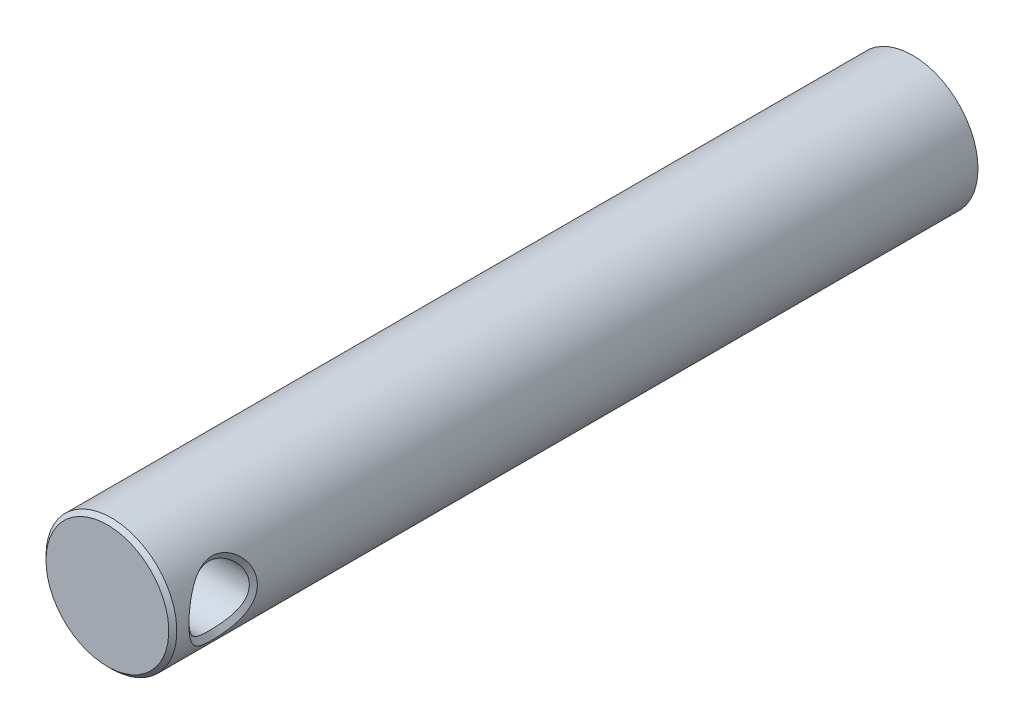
ISO-10303-21;
HEADER;
FILE_DESCRIPTION(('STEP AP214'),'2;1');
FILE_NAME('part.step','',(''),(''),'','','');
FILE_SCHEMA(('AUTOMOTIVE_DESIGN { 1 0 10303 214 1 1 1 1 }'));
ENDSEC;
DATA;
#1=APPLICATION_CONTEXT('core data for automotive mechanical design processes');
#2=APPLICATION_PROTOCOL_DEFINITION('international standard','automotive_design',2000,#1);
#3=PRODUCT_CONTEXT('',#1,'mechanical');
#4=PRODUCT('Part','Part','',(#3));
#5=PRODUCT_RELATED_PRODUCT_CATEGORY('part','',(#4));
#6=PRODUCT_DEFINITION_FORMATION('','',#4);
#7=PRODUCT_DEFINITION_CONTEXT('part definition',#1,'design');
#8=PRODUCT_DEFINITION('design','',#6,#7);
#9=PRODUCT_DEFINITION_SHAPE('','',#8);
#10=(LENGTH_UNIT() NAMED_UNIT(*) SI_UNIT(.MILLI.,.METRE.));
#11=(NAMED_UNIT(*) PLANE_ANGLE_UNIT() SI_UNIT($,.RADIAN.));
#12=(NAMED_UNIT(*) SI_UNIT($,.STERADIAN.) SOLID_ANGLE_UNIT());
#13=UNCERTAINTY_MEASURE_WITH_UNIT(LENGTH_MEASURE(1.E-05),#10,'distance_accuracy_value','');
#14=(GEOMETRIC_REPRESENTATION_CONTEXT(3) GLOBAL_UNCERTAINTY_ASSIGNED_CONTEXT((#13)) GLOBAL_UNIT_ASSIGNED_CONTEXT((#10,
#11,#12)) REPRESENTATION_CONTEXT('',''));
#15=CARTESIAN_POINT('',(0.,0.,0.));
#16=DIRECTION('',(0.,0.,1.));
#17=DIRECTION('',(1.,0.,0.));
#18=AXIS2_PLACEMENT_3D('',#15,#16,#17);
#19=CARTESIAN_POINT('',(0.,0.,400.));
#20=DIRECTION('',(0.,0.,-0.999999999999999));
#21=DIRECTION('',(-1.,0.,0.));
#22=AXIS2_PLACEMENT_3D('',#19,#20,#21);
#23=CYLINDRICAL_SURFACE('',#22,32.5);
#24=CARTESIAN_POINT('',(-32.5,2.96204033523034E-13,391.999991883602));
#25=CARTESIAN_POINT('',(-32.4999786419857,0.193386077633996,391.999947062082));
#26=CARTESIAN_POINT('',(-32.498186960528,0.38676641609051,391.996943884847));
#27=CARTESIAN_POINT('',(-32.4911299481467,0.774195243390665,391.985094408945));
#28=CARTESIAN_POINT('',(-32.4858483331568,0.968242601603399,391.976220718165));
#29=CARTESIAN_POINT('',(-32.4718620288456,1.35636613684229,391.952675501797));
#30=CARTESIAN_POINT('',(-32.4631484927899,1.55044108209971,391.937988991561));
#31=CARTESIAN_POINT('',(-32.4423402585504,1.93798264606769,391.902848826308));
#32=CARTESIAN_POINT('',(-32.4302439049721,2.13144891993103,391.882392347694));
#33=CARTESIAN_POINT('',(-32.4027165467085,2.51713465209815,391.835751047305));
#34=CARTESIAN_POINT('',(-32.3872909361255,2.70935561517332,391.809575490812));
#35=CARTESIAN_POINT('',(-32.3531428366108,3.09190955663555,391.751517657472));
#36=CARTESIAN_POINT('',(-32.334432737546,3.28224688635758,391.719656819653));
#37=CARTESIAN_POINT('',(-32.2937685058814,3.66054398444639,391.650283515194));
#38=CARTESIAN_POINT('',(-32.2718310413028,3.84851087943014,391.612800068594));
#39=CARTESIAN_POINT('',(-32.224984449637,4.22223950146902,391.53255041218));
#40=CARTESIAN_POINT('',(-32.2000859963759,4.40800664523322,391.489803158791));
#41=CARTESIAN_POINT('',(-32.1473512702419,4.77736950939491,391.398971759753));
#42=CARTESIAN_POINT('',(-32.1195215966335,4.96096911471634,391.35089959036));
#43=CARTESIAN_POINT('',(-32.0610124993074,5.32604377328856,391.249460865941));
#44=CARTESIAN_POINT('',(-32.0303358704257,5.50752071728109,391.196099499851));
#45=CARTESIAN_POINT('',(-31.9662066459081,5.86839233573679,391.084100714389));
#46=CARTESIAN_POINT('',(-31.9327533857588,6.04778649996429,391.025462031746));
#47=CARTESIAN_POINT('',(-31.8631469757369,6.40453351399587,390.902927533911));
#48=CARTESIAN_POINT('',(-31.8269900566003,6.58188310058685,390.839024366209));
#49=CARTESIAN_POINT('',(-31.7520581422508,6.93458158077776,390.706004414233));
#50=CARTESIAN_POINT('',(-31.713276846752,7.10992438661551,390.636875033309));
#51=CARTESIAN_POINT('',(-31.633158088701,7.45829583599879,390.493316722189));
#52=CARTESIAN_POINT('',(-31.5918153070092,7.63131869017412,390.418876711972));
#53=CARTESIAN_POINT('',(-31.5068319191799,7.97465982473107,390.264984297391));
#54=CARTESIAN_POINT('',(-31.4631901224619,8.14497664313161,390.185529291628));
#55=CARTESIAN_POINT('',(-31.3738471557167,8.48249014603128,390.021858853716));
#56=CARTESIAN_POINT('',(-31.3281485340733,8.64969034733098,389.93764928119));
#57=CARTESIAN_POINT('',(-31.2349350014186,8.98055553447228,389.764727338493));
#58=CARTESIAN_POINT('',(-31.1874259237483,9.14422958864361,389.67602917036));
#59=CARTESIAN_POINT('',(-31.0908402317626,9.46763913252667,389.494403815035));
#60=CARTESIAN_POINT('',(-31.0417722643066,9.6273897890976,389.401499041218));
#61=CARTESIAN_POINT('',(-30.9422824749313,9.942531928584,389.211644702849));
#62=CARTESIAN_POINT('',(-30.8918714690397,10.0979449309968,389.114725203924));
#63=CARTESIAN_POINT('',(-30.7897561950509,10.4049868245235,388.916818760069));
#64=CARTESIAN_POINT('',(-30.7380563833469,10.5566258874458,388.815845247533));
#65=CARTESIAN_POINT('',(-30.5811693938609,11.0061522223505,388.506727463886));
#66=CARTESIAN_POINT('',(-30.4740798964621,11.2990097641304,388.292168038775));
#67=CARTESIAN_POINT('',(-30.2561676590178,11.8703493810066,387.846269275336));
#68=CARTESIAN_POINT('',(-30.1453436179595,12.1488263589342,387.614924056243));
#69=CARTESIAN_POINT('',(-29.9211859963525,12.6909198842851,387.135750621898));
#70=CARTESIAN_POINT('',(-29.8078490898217,12.9545148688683,386.887899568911));
#71=CARTESIAN_POINT('',(-29.5808322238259,13.4647591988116,386.377309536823));
#72=CARTESIAN_POINT('',(-29.4671547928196,13.711463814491,386.114624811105));
#73=CARTESIAN_POINT('',(-29.2975047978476,14.0685291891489,385.709714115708));
#74=CARTESIAN_POINT('',(-29.2411883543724,14.1852097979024,385.573156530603));
#75=CARTESIAN_POINT('',(-29.1290991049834,14.4140633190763,385.296639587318));
#76=CARTESIAN_POINT('',(-29.0733253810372,14.526245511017,385.156688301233));
#77=CARTESIAN_POINT('',(-28.9625243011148,14.7460262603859,384.873475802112));
#78=CARTESIAN_POINT('',(-28.9074955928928,14.8536341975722,384.730222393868));
#79=CARTESIAN_POINT('',(-28.798384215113,15.0641972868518,384.440490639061));
#80=CARTESIAN_POINT('',(-28.7442997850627,15.1671618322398,384.294019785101));
#81=CARTESIAN_POINT('',(-28.6372774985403,15.3683671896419,383.99793998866));
#82=CARTESIAN_POINT('',(-28.5843375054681,15.4666173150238,383.848338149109));
#83=CARTESIAN_POINT('',(-28.4798040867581,15.6583237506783,383.546082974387));
#84=CARTESIAN_POINT('',(-28.4282082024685,15.7517891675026,383.393436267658));
#85=CARTESIAN_POINT('',(-28.3265640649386,15.933855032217,383.085177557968));
#86=CARTESIAN_POINT('',(-28.2765131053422,16.0224642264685,382.929571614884));
#87=CARTESIAN_POINT('',(-28.1781558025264,16.1947506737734,382.615482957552));
#88=CARTESIAN_POINT('',(-28.1298466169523,16.2784361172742,382.457005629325));
#89=CARTESIAN_POINT('',(-28.0351845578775,16.4407934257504,382.137254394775));
#90=CARTESIAN_POINT('',(-27.988828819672,16.5194727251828,381.975985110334));
#91=CARTESIAN_POINT('',(-27.8982307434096,16.6717904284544,381.65076423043));
#92=CARTESIAN_POINT('',(-27.8539857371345,16.7454352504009,381.486816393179));
#93=CARTESIAN_POINT('',(-27.7683007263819,16.8871389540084,381.156057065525));
#94=CARTESIAN_POINT('',(-27.7268572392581,16.9552047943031,380.989249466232));
#95=CARTESIAN_POINT('',(-27.6468541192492,17.0857367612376,380.65306901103));
#96=CARTESIAN_POINT('',(-27.6082904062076,17.1482108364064,380.483700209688));
#97=CARTESIAN_POINT('',(-27.5342012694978,17.2674804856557,380.142640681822));
#98=CARTESIAN_POINT('',(-27.4986709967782,17.3242851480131,379.970954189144));
#99=CARTESIAN_POINT('',(-27.4307831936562,17.4321542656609,379.62551807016));
#100=CARTESIAN_POINT('',(-27.3984200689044,17.4832288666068,379.451772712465));
#101=CARTESIAN_POINT('',(-27.3370063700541,17.5795716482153,379.102473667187));
#102=CARTESIAN_POINT('',(-27.3079494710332,17.6248509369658,378.926924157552));
#103=CARTESIAN_POINT('',(-27.2532865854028,17.709538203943,378.574272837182));
#104=CARTESIAN_POINT('',(-27.2276736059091,17.7489580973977,378.397174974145));
#105=CARTESIAN_POINT('',(-27.1800372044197,17.8218615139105,378.041682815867));
#106=CARTESIAN_POINT('',(-27.1580062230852,17.8553575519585,377.863292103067));
#107=CARTESIAN_POINT('',(-27.1176723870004,17.9163484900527,377.505470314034));
#108=CARTESIAN_POINT('',(-27.0993615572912,17.9438562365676,377.326042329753));
#109=CARTESIAN_POINT('',(-27.0666059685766,17.9928060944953,376.966402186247));
#110=CARTESIAN_POINT('',(-27.0521530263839,18.0142610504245,376.786192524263));
#111=CARTESIAN_POINT('',(-27.0272527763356,18.051041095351,376.425245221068));
#112=CARTESIAN_POINT('',(-27.0167973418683,18.0663786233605,376.244509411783));
#113=CARTESIAN_POINT('',(-27.0000245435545,18.0908602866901,375.882766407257));
#114=CARTESIAN_POINT('',(-26.9936994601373,18.1000159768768,375.701760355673));
#115=CARTESIAN_POINT('',(-26.985344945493,18.1120698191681,375.339732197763));
#116=CARTESIAN_POINT('',(-26.9833085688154,18.1149780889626,375.158710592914));
#117=CARTESIAN_POINT('',(-26.983594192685,18.1144767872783,374.796304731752));
#118=CARTESIAN_POINT('',(-26.9859252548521,18.1110540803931,374.614920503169));
#119=CARTESIAN_POINT('',(-26.9947527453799,18.0979853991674,374.251630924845));
#120=CARTESIAN_POINT('',(-27.0012686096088,18.0883103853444,374.069727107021));
#121=CARTESIAN_POINT('',(-27.0183998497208,18.0627796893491,373.70594215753));
#122=CARTESIAN_POINT('',(-27.0290287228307,18.0469036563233,373.524063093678));
#123=CARTESIAN_POINT('',(-27.0542952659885,18.0090134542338,373.160873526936));
#124=CARTESIAN_POINT('',(-27.0689405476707,17.986987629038,372.979564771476));
#125=CARTESIAN_POINT('',(-27.1021534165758,17.9368439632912,372.618061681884));
#126=CARTESIAN_POINT('',(-27.1207229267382,17.9087231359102,372.437867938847));
#127=CARTESIAN_POINT('',(-27.1617051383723,17.8464209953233,372.079143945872));
#128=CARTESIAN_POINT('',(-27.1841142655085,17.812245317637,371.900612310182));
#129=CARTESIAN_POINT('',(-27.2326583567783,17.7379251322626,371.545780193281));
#130=CARTESIAN_POINT('',(-27.2587839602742,17.6977956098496,371.369475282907));
#131=CARTESIAN_POINT('',(-27.3143344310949,17.611989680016,371.019278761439));
#132=CARTESIAN_POINT('',(-27.3437499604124,17.5663289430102,370.845381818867));
#133=CARTESIAN_POINT('',(-27.4057586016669,17.4694596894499,370.499974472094));
#134=CARTESIAN_POINT('',(-27.4383473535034,17.4182587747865,370.328461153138));
#135=CARTESIAN_POINT('',(-27.5065211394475,17.3103908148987,369.987760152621));
#136=CARTESIAN_POINT('',(-27.5421062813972,17.2537235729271,369.818572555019));
#137=CARTESIAN_POINT('',(-27.6161085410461,17.134982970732,369.482467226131));
#138=CARTESIAN_POINT('',(-27.654529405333,17.0729024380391,369.315552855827));
#139=CARTESIAN_POINT('',(-27.7340361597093,16.9433934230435,368.983940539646));
#140=CARTESIAN_POINT('',(-27.7751286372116,16.8759516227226,368.819249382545));
#141=CARTESIAN_POINT('',(-27.8598309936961,16.7357678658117,368.491933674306));
#142=CARTESIAN_POINT('',(-27.9034506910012,16.6630049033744,368.329320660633));
#143=CARTESIAN_POINT('',(-27.9931907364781,16.5118313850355,368.005953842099));
#144=CARTESIAN_POINT('',(-28.0393265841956,16.433384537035,367.845221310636));
#145=CARTESIAN_POINT('',(-28.1337891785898,16.2711130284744,367.525925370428));
#146=CARTESIAN_POINT('',(-28.1821268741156,16.1872603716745,367.367379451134));
#147=CARTESIAN_POINT('',(-28.2806779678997,16.0144392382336,367.052893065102));
#148=CARTESIAN_POINT('',(-28.3308975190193,15.9254533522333,366.896964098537));
#149=CARTESIAN_POINT('',(-28.4328919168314,15.742636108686,366.588146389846));
#150=CARTESIAN_POINT('',(-28.4846690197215,15.6487975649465,366.435262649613));
#151=CARTESIAN_POINT('',(-28.5894536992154,15.4565631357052,366.132955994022));
#152=CARTESIAN_POINT('',(-28.6424605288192,15.358169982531,365.983531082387));
#153=CARTESIAN_POINT('',(-28.7494060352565,15.1570205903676,365.688600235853));
#154=CARTESIAN_POINT('',(-28.8033419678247,15.0542762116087,365.543085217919));
#155=CARTESIAN_POINT('',(-28.9119907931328,14.8445214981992,365.255571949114));
#156=CARTESIAN_POINT('',(-28.9667033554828,14.7375129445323,365.113572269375));
#157=CARTESIAN_POINT('',(-29.1320152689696,14.409599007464,364.692122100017));
#158=CARTESIAN_POINT('',(-29.243521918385,14.1823046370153,364.417950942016));
#159=CARTESIAN_POINT('',(-29.4679822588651,13.7099383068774,363.882899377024));
#160=CARTESIAN_POINT('',(-29.5809405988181,13.4647701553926,363.622106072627));
#161=CARTESIAN_POINT('',(-29.806961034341,12.9566570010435,363.114036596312));
#162=CARTESIAN_POINT('',(-29.9200171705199,12.6935891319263,362.866880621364));
#163=CARTESIAN_POINT('',(-30.144062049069,12.1513298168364,362.38769858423));
#164=CARTESIAN_POINT('',(-30.2550418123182,11.8720833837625,362.155730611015));
#165=CARTESIAN_POINT('',(-30.4735785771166,11.2983029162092,361.707897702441));
#166=CARTESIAN_POINT('',(-30.5811253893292,11.0037291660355,361.49207853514));
#167=CARTESIAN_POINT('',(-30.7387466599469,10.5512992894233,361.181219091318));
#168=CARTESIAN_POINT('',(-30.7907255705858,10.3985544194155,361.079639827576));
#169=CARTESIAN_POINT('',(-30.8933286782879,10.0894969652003,360.880782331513));
#170=CARTESIAN_POINT('',(-30.9439507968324,9.93317951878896,360.78351056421));
#171=CARTESIAN_POINT('',(-31.0436726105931,9.61706902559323,360.593362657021));
#172=CARTESIAN_POINT('',(-31.0927698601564,9.45727103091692,360.500493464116));
#173=CARTESIAN_POINT('',(-31.1892777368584,9.13428352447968,360.319239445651));
#174=CARTESIAN_POINT('',(-31.2366854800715,8.971088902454,360.230862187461));
#175=CARTESIAN_POINT('',(-31.3296493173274,8.64139435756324,360.05868250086));
#176=CARTESIAN_POINT('',(-31.3752019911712,8.47488910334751,359.974888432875));
#177=CARTESIAN_POINT('',(-31.4642909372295,8.13865939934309,359.811963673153));
#178=CARTESIAN_POINT('',(-31.5078231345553,7.96892934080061,359.732842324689));
#179=CARTESIAN_POINT('',(-31.5927067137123,7.6263347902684,359.579356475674));
#180=CARTESIAN_POINT('',(-31.6340532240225,7.45346436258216,359.505002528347));
#181=CARTESIAN_POINT('',(-31.7143721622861,7.10480103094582,359.361176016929));
#182=CARTESIAN_POINT('',(-31.7533404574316,6.92900367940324,359.29171191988));
#183=CARTESIAN_POINT('',(-31.8285865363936,6.57522255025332,359.158138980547));
#184=CARTESIAN_POINT('',(-31.8648694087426,6.39724369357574,359.094019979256));
#185=CARTESIAN_POINT('',(-31.9346614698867,6.03924793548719,358.97117248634));
#186=CARTESIAN_POINT('',(-31.9681752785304,5.8592350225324,358.912434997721));
#187=CARTESIAN_POINT('',(-32.0323684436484,5.4971878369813,358.800341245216));
#188=CARTESIAN_POINT('',(-32.0630498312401,5.31515511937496,358.746981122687));
#189=CARTESIAN_POINT('',(-32.1215233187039,4.94908805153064,358.645623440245));
#190=CARTESIAN_POINT('',(-32.1493146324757,4.76505317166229,358.597627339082));
#191=CARTESIAN_POINT('',(-32.2019393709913,4.39499495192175,358.507004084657));
#192=CARTESIAN_POINT('',(-32.2267689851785,4.20896937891,358.464383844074));
#193=CARTESIAN_POINT('',(-32.2734543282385,3.83494719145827,358.384423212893));
#194=CARTESIAN_POINT('',(-32.295302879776,3.6469469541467,358.347095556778));
#195=CARTESIAN_POINT('',(-32.3358107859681,3.26866666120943,358.277995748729));
#196=CARTESIAN_POINT('',(-32.3544547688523,3.07838005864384,358.24625035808));
#197=CARTESIAN_POINT('',(-32.3884862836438,2.69586294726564,358.188396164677));
#198=CARTESIAN_POINT('',(-32.4038602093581,2.50362767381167,358.16231090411));
#199=CARTESIAN_POINT('',(-32.4312863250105,2.11775655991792,358.115845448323));
#200=CARTESIAN_POINT('',(-32.4433303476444,1.92411845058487,358.095479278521));
#201=CARTESIAN_POINT('',(-32.464022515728,1.53598344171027,358.060537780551));
#202=CARTESIAN_POINT('',(-32.4726679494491,1.34148598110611,358.045967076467));
#203=CARTESIAN_POINT('',(-32.4864931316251,0.952175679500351,358.022694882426));
#204=CARTESIAN_POINT('',(-32.4916756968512,0.757363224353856,358.013988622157));
#205=CARTESIAN_POINT('',(-32.4984964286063,0.367965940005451,358.00253591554));
#206=CARTESIAN_POINT('',(-32.5001430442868,0.173381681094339,357.999775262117));
#207=CARTESIAN_POINT('',(-32.4998431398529,-0.215763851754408,358.000264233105));
#208=CARTESIAN_POINT('',(-32.4978968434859,-0.410325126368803,358.003513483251));
#209=CARTESIAN_POINT('',(-32.4905157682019,-0.799638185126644,358.015891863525));
#210=CARTESIAN_POINT('',(-32.4850730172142,-0.994389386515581,358.02503443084));
#211=CARTESIAN_POINT('',(-32.4707464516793,-1.38354700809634,358.049154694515));
#212=CARTESIAN_POINT('',(-32.4618601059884,-1.57795306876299,358.064136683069));
#213=CARTESIAN_POINT('',(-32.4407015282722,-1.96588354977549,358.09988106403));
#214=CARTESIAN_POINT('',(-32.4284321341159,-2.15940857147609,358.120638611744));
#215=CARTESIAN_POINT('',(-32.4005623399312,-2.54504001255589,358.167878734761));
#216=CARTESIAN_POINT('',(-32.3849700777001,-2.73714873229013,358.1943473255));
#217=CARTESIAN_POINT('',(-32.3505031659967,-3.11940812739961,358.252966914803));
#218=CARTESIAN_POINT('',(-32.3316419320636,-3.30956356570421,358.285094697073));
#219=CARTESIAN_POINT('',(-32.2906988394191,-3.68749561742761,358.354961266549));
#220=CARTESIAN_POINT('',(-32.2686335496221,-3.87527937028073,358.392671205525));
#221=CARTESIAN_POINT('',(-32.2215338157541,-4.24858635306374,358.4733756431));
#222=CARTESIAN_POINT('',(-32.1965107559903,-4.4341154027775,358.516349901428));
#223=CARTESIAN_POINT('',(-32.1435447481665,-4.80293371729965,358.60760792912));
#224=CARTESIAN_POINT('',(-32.1156093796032,-4.98622747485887,358.655877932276));
#225=CARTESIAN_POINT('',(-32.0569135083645,-5.35060782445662,358.757672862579));
#226=CARTESIAN_POINT('',(-32.0261570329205,-5.53169715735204,358.811190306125));
#227=CARTESIAN_POINT('',(-31.9619017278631,-5.89169767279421,358.923445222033));
#228=CARTESIAN_POINT('',(-31.9284037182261,-6.0706094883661,358.98218113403));
#229=CARTESIAN_POINT('',(-31.8587496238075,-6.42628210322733,359.104838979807));
#230=CARTESIAN_POINT('',(-31.8225914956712,-6.60304112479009,359.168764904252));
#231=CARTESIAN_POINT('',(-31.7476989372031,-6.954478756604,359.301759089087));
#232=CARTESIAN_POINT('',(-31.7089595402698,-7.12915254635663,359.370837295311));
#233=CARTESIAN_POINT('',(-31.6289059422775,-7.47632543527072,359.514329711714));
#234=CARTESIAN_POINT('',(-31.5875844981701,-7.64881662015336,359.588759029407));
#235=CARTESIAN_POINT('',(-31.5026264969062,-7.99123780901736,359.74266326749));
#236=CARTESIAN_POINT('',(-31.4589869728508,-8.16116415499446,359.82214468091));
#237=CARTESIAN_POINT('',(-31.369638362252,-8.49799668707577,359.985888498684));
#238=CARTESIAN_POINT('',(-31.3239306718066,-8.6649048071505,360.070147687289));
#239=CARTESIAN_POINT('',(-31.2306966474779,-8.99524264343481,360.243175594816));
#240=CARTESIAN_POINT('',(-31.183175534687,-9.15868050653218,360.33193157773));
#241=CARTESIAN_POINT('',(-31.0865719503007,-9.4816328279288,360.51366361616));
#242=CARTESIAN_POINT('',(-31.0374979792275,-9.64116224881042,360.606617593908));
#243=CARTESIAN_POINT('',(-30.9380078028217,-9.95582894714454,360.796554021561));
#244=CARTESIAN_POINT('',(-30.8876026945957,-10.1109883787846,360.893505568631));
#245=CARTESIAN_POINT('',(-30.7855252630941,-10.4174829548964,361.091425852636));
#246=CARTESIAN_POINT('',(-30.7338578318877,-10.568829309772,361.192379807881));
#247=CARTESIAN_POINT('',(-30.5771270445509,-11.017365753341,361.50132217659));
#248=CARTESIAN_POINT('',(-30.4701776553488,-11.3095481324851,361.715690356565));
#249=CARTESIAN_POINT('',(-30.2526171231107,-11.8794453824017,362.161062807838));
#250=CARTESIAN_POINT('',(-30.142006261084,-12.1571613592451,362.392065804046));
#251=CARTESIAN_POINT('',(-29.9183116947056,-12.6977032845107,362.870483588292));
#252=CARTESIAN_POINT('',(-29.8052250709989,-12.960510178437,363.117918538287));
#253=CARTESIAN_POINT('',(-29.578679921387,-13.4693597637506,363.627679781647));
#254=CARTESIAN_POINT('',(-29.4652235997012,-13.7154513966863,363.889958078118));
#255=CARTESIAN_POINT('',(-29.2958942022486,-14.0716925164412,364.294237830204));
#256=CARTESIAN_POINT('',(-29.2396748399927,-14.1881299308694,364.430601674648));
#257=CARTESIAN_POINT('',(-29.1277721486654,-14.4165331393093,364.706734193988));
#258=CARTESIAN_POINT('',(-29.0720879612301,-14.5285075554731,364.846495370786));
#259=CARTESIAN_POINT('',(-28.9614591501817,-14.7479040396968,365.129329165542));
#260=CARTESIAN_POINT('',(-28.9065132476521,-14.8553349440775,365.272394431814));
#261=CARTESIAN_POINT('',(-28.7975614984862,-15.0655704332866,365.561749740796));
#262=CARTESIAN_POINT('',(-28.7435539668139,-15.1683839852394,365.708032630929));
#263=CARTESIAN_POINT('',(-28.6366803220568,-15.3693090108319,366.003734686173));
#264=CARTESIAN_POINT('',(-28.5838121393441,-15.4674294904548,366.153146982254));
#265=CARTESIAN_POINT('',(-28.4794180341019,-15.6588934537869,366.455019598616));
#266=CARTESIAN_POINT('',(-28.4278897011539,-15.7522458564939,366.60747342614));
#267=CARTESIAN_POINT('',(-28.3263771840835,-15.9340977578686,366.915341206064));
#268=CARTESIAN_POINT('',(-28.2763903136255,-16.0226059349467,367.07074914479));
#269=CARTESIAN_POINT('',(-28.1781586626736,-16.1946973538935,367.384435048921));
#270=CARTESIAN_POINT('',(-28.1299110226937,-16.2782888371,367.542707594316));
#271=CARTESIAN_POINT('',(-28.0353700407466,-16.4404613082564,367.862040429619));
#272=CARTESIAN_POINT('',(-27.9890737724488,-16.5190498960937,368.023095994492));
#273=CARTESIAN_POINT('',(-27.898594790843,-16.671181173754,368.347880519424));
#274=CARTESIAN_POINT('',(-27.8544092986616,-16.7447305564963,368.511605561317));
#275=CARTESIAN_POINT('',(-27.7688296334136,-16.886267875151,368.841894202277));
#276=CARTESIAN_POINT('',(-27.7274318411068,-16.9542630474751,369.008453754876));
#277=CARTESIAN_POINT('',(-27.6475083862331,-17.0846738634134,369.344121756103));
#278=CARTESIAN_POINT('',(-27.6089785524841,-17.1470976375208,369.51322605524));
#279=CARTESIAN_POINT('',(-27.5349453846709,-17.2662866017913,369.853746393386));
#280=CARTESIAN_POINT('',(-27.4994371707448,-17.3230609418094,370.025158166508));
#281=CARTESIAN_POINT('',(-27.4315821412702,-17.4308880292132,370.370041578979));
#282=CARTESIAN_POINT('',(-27.3992297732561,-17.4819508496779,370.543508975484));
#283=CARTESIAN_POINT('',(-27.3378265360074,-17.5782876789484,370.892255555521));
#284=CARTESIAN_POINT('',(-27.3087694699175,-17.6235725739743,371.067530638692));
#285=CARTESIAN_POINT('',(-27.2540955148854,-17.7082875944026,371.419643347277));
#286=CARTESIAN_POINT('',(-27.2284718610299,-17.7477292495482,371.596477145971));
#287=CARTESIAN_POINT('',(-27.1808036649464,-17.8206917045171,371.951458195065));
#288=CARTESIAN_POINT('',(-27.1587519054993,-17.8542244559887,372.129602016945));
#289=CARTESIAN_POINT('',(-27.118366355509,-17.9153032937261,372.486953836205));
#290=CARTESIAN_POINT('',(-27.1000250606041,-17.9428614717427,372.666158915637));
#291=CARTESIAN_POINT('',(-27.0671986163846,-17.9919257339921,373.025383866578));
#292=CARTESIAN_POINT('',(-27.0527058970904,-18.0134437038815,373.205401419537));
#293=CARTESIAN_POINT('',(-27.0277165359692,-18.0503620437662,373.566001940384));
#294=CARTESIAN_POINT('',(-27.0172125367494,-18.0657736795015,373.746583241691));
#295=CARTESIAN_POINT('',(-27.0003328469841,-18.0904158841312,374.108061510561));
#296=CARTESIAN_POINT('',(-26.9939503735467,-18.099656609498,374.288957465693));
#297=CARTESIAN_POINT('',(-26.9854731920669,-18.1118879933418,374.650816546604));
#298=CARTESIAN_POINT('',(-26.9833726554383,-18.1148871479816,374.831779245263));
#299=CARTESIAN_POINT('',(-26.9835158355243,-18.1145889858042,375.194030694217));
#300=CARTESIAN_POINT('',(-26.9857675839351,-18.1112800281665,375.375319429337));
#301=CARTESIAN_POINT('',(-26.9944254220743,-18.0984601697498,375.738326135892));
#302=CARTESIAN_POINT('',(-27.0008486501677,-18.0889236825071,375.920042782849));
#303=CARTESIAN_POINT('',(-27.0177894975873,-18.0636805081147,376.283416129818));
#304=CARTESIAN_POINT('',(-27.0283196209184,-18.0479549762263,376.46507093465));
#305=CARTESIAN_POINT('',(-27.0533877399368,-18.0103697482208,376.827829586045));
#306=CARTESIAN_POINT('',(-27.0679335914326,-17.9884980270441,377.008931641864));
#307=CARTESIAN_POINT('',(-27.1009503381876,-17.9386605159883,377.370094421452));
#308=CARTESIAN_POINT('',(-27.1194245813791,-17.910689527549,377.550154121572));
#309=CARTESIAN_POINT('',(-27.1602268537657,-17.8486724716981,377.908736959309));
#310=CARTESIAN_POINT('',(-27.1825538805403,-17.8146279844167,378.087260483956));
#311=CARTESIAN_POINT('',(-27.2309365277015,-17.7405681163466,378.442266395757));
#312=CARTESIAN_POINT('',(-27.2569865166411,-17.7005617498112,378.618751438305));
#313=CARTESIAN_POINT('',(-27.3123774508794,-17.615017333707,378.969544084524));
#314=CARTESIAN_POINT('',(-27.3417130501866,-17.5694882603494,379.143854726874));
#315=CARTESIAN_POINT('',(-27.4036111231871,-17.4728048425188,379.490305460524));
#316=CARTESIAN_POINT('',(-27.4361731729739,-17.4216512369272,379.662445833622));
#317=CARTESIAN_POINT('',(-27.5043827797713,-17.3137358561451,380.004605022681));
#318=CARTESIAN_POINT('',(-27.5400344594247,-17.2569665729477,380.174620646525));
#319=CARTESIAN_POINT('',(-27.614305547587,-17.1378051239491,380.512569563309));
#320=CARTESIAN_POINT('',(-27.652932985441,-17.0753976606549,380.680495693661));
#321=CARTESIAN_POINT('',(-27.7330252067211,-16.9449581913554,381.014313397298));
#322=CARTESIAN_POINT('',(-27.7745012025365,-16.8769037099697,381.180193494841));
#323=CARTESIAN_POINT('',(-27.8601541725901,-16.7352061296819,381.509802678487));
#324=CARTESIAN_POINT('',(-27.9043428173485,-16.6615384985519,381.67351816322));
#325=CARTESIAN_POINT('',(-27.9948030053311,-16.5092594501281,381.998143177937));
#326=CARTESIAN_POINT('',(-28.0410755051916,-16.4306457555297,382.159051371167));
#327=CARTESIAN_POINT('',(-28.135507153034,-16.2685427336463,382.477863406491));
#328=CARTESIAN_POINT('',(-28.1836665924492,-16.18505265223,382.635766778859));
#329=CARTESIAN_POINT('',(-28.2816774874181,-16.0132559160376,382.948536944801));
#330=CARTESIAN_POINT('',(-28.3315300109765,-15.9249461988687,383.103401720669));
#331=CARTESIAN_POINT('',(-28.4327415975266,-15.7435564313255,383.410055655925));
#332=CARTESIAN_POINT('',(-28.4841022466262,-15.6504712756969,383.561841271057));
#333=CARTESIAN_POINT('',(-28.5881424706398,-15.4595799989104,383.862299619));
#334=CARTESIAN_POINT('',(-28.6408239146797,-15.3617669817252,384.010967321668));
#335=CARTESIAN_POINT('',(-28.7473190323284,-15.1614680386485,384.305152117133));
#336=CARTESIAN_POINT('',(-28.8011346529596,-15.0589736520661,384.450662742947));
#337=CARTESIAN_POINT('',(-28.9097112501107,-14.849360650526,384.738495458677));
#338=CARTESIAN_POINT('',(-28.9644740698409,-14.7422322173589,384.880809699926));
#339=CARTESIAN_POINT('',(-29.0747591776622,-14.5233972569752,385.162212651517));
#340=CARTESIAN_POINT('',(-29.1302830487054,-14.4116797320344,385.301292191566));
#341=CARTESIAN_POINT('',(-29.2419016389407,-14.1837210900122,385.576184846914));
#342=CARTESIAN_POINT('',(-29.2979975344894,-14.0674679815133,385.71198751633));
#343=CARTESIAN_POINT('',(-29.4671413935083,-13.7113958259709,386.115091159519));
#344=CARTESIAN_POINT('',(-29.5805195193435,-13.4653018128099,386.37675420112));
#345=CARTESIAN_POINT('',(-29.8071771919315,-12.9560034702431,386.886350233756));
#346=CARTESIAN_POINT('',(-29.9204520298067,-12.6927049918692,387.13419101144));
#347=CARTESIAN_POINT('',(-30.1446364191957,-12.1507469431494,387.613557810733));
#348=CARTESIAN_POINT('',(-30.2555462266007,-11.8720890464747,387.84508560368));
#349=CARTESIAN_POINT('',(-30.473701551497,-11.3001421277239,388.29147274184));
#350=CARTESIAN_POINT('',(-30.5809456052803,-11.0068473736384,388.506325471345));
#351=CARTESIAN_POINT('',(-30.7380758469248,-10.5565982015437,388.815898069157));
#352=CARTESIAN_POINT('',(-30.7898672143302,-10.4046800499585,388.91704192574));
#353=CARTESIAN_POINT('',(-30.8921426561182,-10.0971103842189,389.115247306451));
#354=CARTESIAN_POINT('',(-30.9426226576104,-9.94144959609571,389.21229658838));
#355=CARTESIAN_POINT('',(-31.0421652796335,-9.6259481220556,389.402248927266));
#356=CARTESIAN_POINT('',(-31.0912188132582,-9.46608945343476,389.495126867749));
#357=CARTESIAN_POINT('',(-31.1877252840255,-9.14260449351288,389.676602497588));
#358=CARTESIAN_POINT('',(-31.2351711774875,-8.97896586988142,389.765181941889));
#359=CARTESIAN_POINT('',(-31.3282357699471,-8.64829585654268,389.937823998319));
#360=CARTESIAN_POINT('',(-31.373849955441,-8.48125745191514,390.021875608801));
#361=CARTESIAN_POINT('',(-31.4630342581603,-8.14418061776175,390.185249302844));
#362=CARTESIAN_POINT('',(-31.5066028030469,-7.97414001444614,390.264567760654));
#363=CARTESIAN_POINT('',(-31.591472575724,-7.63144620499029,390.418252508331));
#364=CARTESIAN_POINT('',(-31.6327755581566,-7.45879515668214,390.492622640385));
#365=CARTESIAN_POINT('',(-31.7129321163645,-7.11115348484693,390.63625308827));
#366=CARTESIAN_POINT('',(-31.7517895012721,-6.93616704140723,390.705521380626));
#367=CARTESIAN_POINT('',(-31.8268275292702,-6.58332913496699,390.838837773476));
#368=CARTESIAN_POINT('',(-31.8630039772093,-6.40547369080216,390.902877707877));
#369=CARTESIAN_POINT('',(-31.9326604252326,-6.04707755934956,391.02575875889));
#370=CARTESIAN_POINT('',(-31.9661353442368,-5.86653253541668,391.084590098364));
#371=CARTESIAN_POINT('',(-32.0302948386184,-5.50301413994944,391.196973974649));
#372=CARTESIAN_POINT('',(-32.0609751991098,-5.32003756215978,391.250518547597));
#373=CARTESIAN_POINT('',(-32.1194640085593,-4.95192238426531,391.352262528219));
#374=CARTESIAN_POINT('',(-32.1472691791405,-4.76678157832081,391.400455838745));
#375=CARTESIAN_POINT('',(-32.199922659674,-4.39460191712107,391.491427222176));
#376=CARTESIAN_POINT('',(-32.2247686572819,-4.20756169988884,391.534201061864));
#377=CARTESIAN_POINT('',(-32.2714197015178,-3.83184801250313,391.614264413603));
#378=CARTESIAN_POINT('',(-32.2932234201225,-3.64317386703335,391.65155153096));
#379=CARTESIAN_POINT('',(-32.3337055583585,-3.26445709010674,391.720572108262));
#380=CARTESIAN_POINT('',(-32.3523836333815,-3.0744143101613,391.752304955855));
#381=CARTESIAN_POINT('',(-32.386530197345,-2.69322525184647,391.810147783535));
#382=CARTESIAN_POINT('',(-32.4019993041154,-2.50207919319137,391.836258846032));
#383=CARTESIAN_POINT('',(-32.4296436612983,-2.11894864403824,391.882788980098));
#384=CARTESIAN_POINT('',(-32.441820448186,-1.92696458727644,391.903210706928));
#385=CARTESIAN_POINT('',(-32.4627958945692,-1.54242349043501,391.938293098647));
#386=CARTESIAN_POINT('',(-32.4715969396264,-1.34986695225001,391.952957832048));
#387=CARTESIAN_POINT('',(-32.4857368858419,-0.9644456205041,391.976457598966));
#388=CARTESIAN_POINT('',(-32.4910789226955,-0.771581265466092,391.985297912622));
#389=CARTESIAN_POINT('',(-32.4982162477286,-0.385812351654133,391.997079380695));
#390=CARTESIAN_POINT('',(-32.5000152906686,-0.192908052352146,392.000026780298));
#391=CARTESIAN_POINT('',(-32.5,2.96204033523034E-13,391.999991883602));
#392=B_SPLINE_CURVE_WITH_KNOTS('',3,(#24,#25,#26,#27,#28,#29,#30,#31,#32,#33,#34,#35,#36,#37,
#38,#39,#40,#41,#42,#43,#44,#45,#46,#47,#48,#49,#50,#51,#52,#53,#54,#55,#56,#57,#58,#59,#60,#61,
#62,#63,#64,#65,#66,#67,#68,#69,#70,#71,#72,#73,#74,#75,#76,#77,#78,#79,#80,#81,#82,#83,#84,#85,
#86,#87,#88,#89,#90,#91,#92,#93,#94,#95,#96,#97,#98,#99,#100,#101,#102,#103,#104,#105,#106,#107,
#108,#109,#110,#111,#112,#113,#114,#115,#116,#117,#118,#119,#120,#121,#122,#123,#124,#125,#126,
#127,#128,#129,#130,#131,#132,#133,#134,#135,#136,#137,#138,#139,#140,#141,#142,#143,#144,#145,
#146,#147,#148,#149,#150,#151,#152,#153,#154,#155,#156,#157,#158,#159,#160,#161,#162,#163,#164,
#165,#166,#167,#168,#169,#170,#171,#172,#173,#174,#175,#176,#177,#178,#179,#180,#181,#182,#183,
#184,#185,#186,#187,#188,#189,#190,#191,#192,#193,#194,#195,#196,#197,#198,#199,#200,#201,#202,
#203,#204,#205,#206,#207,#208,#209,#210,#211,#212,#213,#214,#215,#216,#217,#218,#219,#220,#221,
#222,#223,#224,#225,#226,#227,#228,#229,#230,#231,#232,#233,#234,#235,#236,#237,#238,#239,#240,
#241,#242,#243,#244,#245,#246,#247,#248,#249,#250,#251,#252,#253,#254,#255,#256,#257,#258,#259,
#260,#261,#262,#263,#264,#265,#266,#267,#268,#269,#270,#271,#272,#273,#274,#275,#276,#277,#278,
#279,#280,#281,#282,#283,#284,#285,#286,#287,#288,#289,#290,#291,#292,#293,#294,#295,#296,#297,
#298,#299,#300,#301,#302,#303,#304,#305,#306,#307,#308,#309,#310,#311,#312,#313,#314,#315,#316,
#317,#318,#319,#320,#321,#322,#323,#324,#325,#326,#327,#328,#329,#330,#331,#332,#333,#334,#335,
#336,#337,#338,#339,#340,#341,#342,#343,#344,#345,#346,#347,#348,#349,#350,#351,#352,#353,#354,
#355,#356,#357,#358,#359,#360,#361,#362,#363,#364,#365,#366,#367,#368,#369,#370,#371,#372,#373,
#374,#375,#376,#377,#378,#379,#380,#381,#382,#383,#384,#385,#386,#387,#388,#389,#390,#391),
.UNSPECIFIED.,.F.,.F.,(4,2,2,2,2,2,2,2,2,2,2,2,2,2,2,2,2,2,2,2,2,2,2,2,2,2,2,2,2,2,2,2,2,2,2,2,
2,2,2,2,2,2,2,2,2,2,2,2,2,2,2,2,2,2,2,2,2,2,2,2,2,2,2,2,2,2,2,2,2,2,2,2,2,2,2,2,2,2,2,2,2,2,2,2,
2,2,2,2,2,2,2,2,2,2,2,2,2,2,2,2,2,2,2,2,2,2,2,2,2,2,2,2,2,2,2,2,2,2,2,2,2,2,2,2,2,2,2,2,2,2,2,2,
2,2,2,2,2,2,2,2,2,2,2,2,2,2,2,2,2,2,2,2,2,2,2,2,2,2,2,2,2,2,2,2,2,2,2,2,2,2,2,2,2,2,2,2,2,2,2,2,
2,2,2,4),(0.,0.580120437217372,1.16296701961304,1.74732598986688,2.33197142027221,
2.91567661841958,3.4972254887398,4.07586998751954,4.65248843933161,5.22783538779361,
5.80262337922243,6.37754932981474,6.95329230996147,7.53047017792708,8.10888961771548,
8.6876116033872,9.26563530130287,9.84193234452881,10.415455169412,10.9852665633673,
11.553324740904,12.6881318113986,13.823338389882,14.9601496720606,16.0930430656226,
16.6576902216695,17.2211054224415,17.7833033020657,18.3443075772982,18.9041536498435,
19.462891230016,20.0205869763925,20.5773271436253,21.1332202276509,21.6883908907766,
22.2428582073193,22.7965244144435,23.3492883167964,23.9010575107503,24.4517527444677,
25.001312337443,25.549696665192,26.0968927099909,26.6429186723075,27.1878286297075,
27.7317172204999,28.2747243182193,28.8188593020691,29.3655399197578,29.9140299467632,
30.4635667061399,31.0133733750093,31.5626709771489,32.1106087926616,32.6570290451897,
33.2027088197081,33.7484082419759,34.294842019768,34.8426783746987,35.3928081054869,
35.9468273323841,36.5039910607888,37.0631703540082,37.6232028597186,38.1829036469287,
38.7411663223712,39.2991982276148,40.4180302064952,41.5434052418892,42.6774875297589,
43.8156805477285,44.9569859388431,45.5288946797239,46.1016345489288,46.6752499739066,
47.2498017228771,47.8253687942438,48.4020502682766,48.9799671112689,49.5588612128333,
50.1366287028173,50.713411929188,51.2897782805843,51.8663009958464,52.4435576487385,
53.0221804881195,53.6035057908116,54.18720452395,54.7723224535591,55.3579063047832,
55.9430132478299,56.5267205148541,57.1103914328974,57.6953978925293,58.280835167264,
58.8657828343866,59.4493140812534,60.0305049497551,60.6087908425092,61.1849192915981,
61.7595840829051,62.3334409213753,62.9071267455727,63.4812579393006,64.0565276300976,
64.6334905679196,65.2112106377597,65.788546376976,66.3643295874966,66.9373744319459,
67.5066082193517,68.073906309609,69.2067069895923,70.339420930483,71.4735513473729,
72.6042035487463,73.1678901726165,73.730429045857,74.2918182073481,74.8520652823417,
75.4111901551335,75.9692276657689,76.5262303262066,77.082271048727,77.6374458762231,
78.1918684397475,78.7455567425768,79.2984233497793,79.8503794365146,80.4013461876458,
80.9512590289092,81.5000719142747,82.0477616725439,82.5943324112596,83.1398199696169,
83.6842964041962,84.227874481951,84.770712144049,85.3145525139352,85.8606414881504,
86.4084062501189,86.9572502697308,87.5065639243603,88.0557348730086,88.6040837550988,
89.1515530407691,89.6989504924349,90.2470899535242,90.7967640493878,91.3487417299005,
91.9032879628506,92.4580914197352,93.0129809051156,93.5682271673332,94.1240799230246,
94.6807694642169,95.2385083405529,95.7974930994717,96.3579060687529,96.9199171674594,
98.0492402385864,99.1853668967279,100.321369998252,101.457821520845,102.026897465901,
102.59756911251,103.171311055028,103.747306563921,104.324643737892,104.902417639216,
105.479737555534,106.056134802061,106.633415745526,107.211758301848,107.790959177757,
108.370813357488,108.951117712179,109.53167459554,110.112295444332,110.692804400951,
111.273041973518,111.852868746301,112.432169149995,113.010855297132),.UNSPECIFIED.);
#393=CARTESIAN_POINT('',(-32.5,2.96204033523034E-13,391.999991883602));
#394=VERTEX_POINT('',#393);
#395=EDGE_CURVE('E45',#394,#394,#392,.F.);
#396=ORIENTED_EDGE('',*,*,#395,.T.);
#397=EDGE_LOOP('',(#396));
#398=FACE_BOUND('',#397,.T.);
#399=CARTESIAN_POINT('',(32.5,2.96637714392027E-13,358.000008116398));
#400=CARTESIAN_POINT('',(32.4999786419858,0.193386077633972,358.000052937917));
#401=CARTESIAN_POINT('',(32.498186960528,0.38676641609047,358.003056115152));
#402=CARTESIAN_POINT('',(32.4911299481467,0.77419524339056,358.014905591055));
#403=CARTESIAN_POINT('',(32.4858483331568,0.968242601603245,358.023779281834));
#404=CARTESIAN_POINT('',(32.4718620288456,1.35636613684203,358.047324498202));
#405=CARTESIAN_POINT('',(32.4631484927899,1.5504410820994,358.062011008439));
#406=CARTESIAN_POINT('',(32.4423402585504,1.93798264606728,358.097151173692));
#407=CARTESIAN_POINT('',(32.4302439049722,2.13144891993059,358.117607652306));
#408=CARTESIAN_POINT('',(32.4027165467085,2.51713465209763,358.164248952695));
#409=CARTESIAN_POINT('',(32.3872909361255,2.70935561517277,358.190424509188));
#410=CARTESIAN_POINT('',(32.3531428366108,3.09190955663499,358.248482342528));
#411=CARTESIAN_POINT('',(32.334432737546,3.28224688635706,358.280343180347));
#412=CARTESIAN_POINT('',(32.2937685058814,3.66054398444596,358.349716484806));
#413=CARTESIAN_POINT('',(32.2718310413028,3.84851087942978,358.387199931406));
#414=CARTESIAN_POINT('',(32.224984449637,4.22223950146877,358.46744958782));
#415=CARTESIAN_POINT('',(32.2000859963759,4.40800664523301,358.510196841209));
#416=CARTESIAN_POINT('',(32.1473512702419,4.77736950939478,358.601028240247));
#417=CARTESIAN_POINT('',(32.1195215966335,4.96096911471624,358.649100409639));
#418=CARTESIAN_POINT('',(32.0610124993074,5.3260437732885,358.750539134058));
#419=CARTESIAN_POINT('',(32.0303358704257,5.50752071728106,358.803900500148));
#420=CARTESIAN_POINT('',(31.9662066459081,5.86839233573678,358.91589928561));
#421=CARTESIAN_POINT('',(31.9327533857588,6.04778649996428,358.974537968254));
#422=CARTESIAN_POINT('',(31.8631469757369,6.40453351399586,359.097072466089));
#423=CARTESIAN_POINT('',(31.8269900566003,6.58188310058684,359.16097563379));
#424=CARTESIAN_POINT('',(31.7520581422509,6.93458158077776,359.293995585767));
#425=CARTESIAN_POINT('',(31.713276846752,7.10992438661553,359.363124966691));
#426=CARTESIAN_POINT('',(31.633158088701,7.4582958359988,359.506683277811));
#427=CARTESIAN_POINT('',(31.5918153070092,7.63131869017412,359.581123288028));
#428=CARTESIAN_POINT('',(31.5068319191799,7.97465982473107,359.735015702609));
#429=CARTESIAN_POINT('',(31.4631901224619,8.14497664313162,359.814470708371));
#430=CARTESIAN_POINT('',(31.3738471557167,8.4824901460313,359.978141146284));
#431=CARTESIAN_POINT('',(31.3281485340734,8.64969034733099,360.06235071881));
#432=CARTESIAN_POINT('',(31.2349350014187,8.98055553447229,360.235272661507));
#433=CARTESIAN_POINT('',(31.1874259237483,9.14422958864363,360.32397082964));
#434=CARTESIAN_POINT('',(31.0908402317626,9.4676391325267,360.505596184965));
#435=CARTESIAN_POINT('',(31.0417722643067,9.62738978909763,360.598500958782));
#436=CARTESIAN_POINT('',(30.9422824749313,9.94253192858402,360.788355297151));
#437=CARTESIAN_POINT('',(30.8918714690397,10.0979449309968,360.885274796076));
#438=CARTESIAN_POINT('',(30.7897561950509,10.4049868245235,361.083181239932));
#439=CARTESIAN_POINT('',(30.738056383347,10.5566258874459,361.184154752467));
#440=CARTESIAN_POINT('',(30.581169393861,11.0061522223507,361.493272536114));
#441=CARTESIAN_POINT('',(30.4740798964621,11.2990097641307,361.707831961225));
#442=CARTESIAN_POINT('',(30.2561676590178,11.8703493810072,362.153730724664));
#443=CARTESIAN_POINT('',(30.1453436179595,12.1488263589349,362.385075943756));
#444=CARTESIAN_POINT('',(29.9211859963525,12.6909198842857,362.864249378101));
#445=CARTESIAN_POINT('',(29.8078490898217,12.9545148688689,363.112100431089));
#446=CARTESIAN_POINT('',(29.5808322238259,13.464759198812,363.622690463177));
#447=CARTESIAN_POINT('',(29.4671547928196,13.7114638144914,363.885375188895));
#448=CARTESIAN_POINT('',(29.2975047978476,14.0685291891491,364.290285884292));
#449=CARTESIAN_POINT('',(29.2411883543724,14.1852097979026,364.426843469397));
#450=CARTESIAN_POINT('',(29.1290991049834,14.4140633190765,364.703360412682));
#451=CARTESIAN_POINT('',(29.0733253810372,14.5262455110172,364.843311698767));
#452=CARTESIAN_POINT('',(28.9625243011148,14.746026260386,365.126524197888));
#453=CARTESIAN_POINT('',(28.9074955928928,14.8536341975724,365.269777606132));
#454=CARTESIAN_POINT('',(28.798384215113,15.0641972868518,365.55950936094));
#455=CARTESIAN_POINT('',(28.7442997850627,15.1671618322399,365.7059802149));
#456=CARTESIAN_POINT('',(28.6372774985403,15.368367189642,366.00206001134));
#457=CARTESIAN_POINT('',(28.5843375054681,15.4666173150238,366.151661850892));
#458=CARTESIAN_POINT('',(28.4798040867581,15.6583237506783,366.453917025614));
#459=CARTESIAN_POINT('',(28.4282082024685,15.7517891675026,366.606563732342));
#460=CARTESIAN_POINT('',(28.3265640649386,15.933855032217,366.914822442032));
#461=CARTESIAN_POINT('',(28.2765131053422,16.0224642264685,367.070428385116));
#462=CARTESIAN_POINT('',(28.1781558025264,16.1947506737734,367.384517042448));
#463=CARTESIAN_POINT('',(28.1298466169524,16.2784361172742,367.542994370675));
#464=CARTESIAN_POINT('',(28.0351845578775,16.4407934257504,367.862745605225));
#465=CARTESIAN_POINT('',(27.988828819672,16.5194727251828,368.024014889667));
#466=CARTESIAN_POINT('',(27.8982307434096,16.6717904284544,368.34923576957));
#467=CARTESIAN_POINT('',(27.8539857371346,16.7454352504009,368.513183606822));
#468=CARTESIAN_POINT('',(27.7683007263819,16.8871389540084,368.843942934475));
#469=CARTESIAN_POINT('',(27.7268572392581,16.9552047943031,369.010750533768));
#470=CARTESIAN_POINT('',(27.6468541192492,17.0857367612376,369.34693098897));
#471=CARTESIAN_POINT('',(27.6082904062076,17.1482108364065,369.516299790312));
#472=CARTESIAN_POINT('',(27.5342012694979,17.2674804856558,369.857359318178));
#473=CARTESIAN_POINT('',(27.4986709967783,17.3242851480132,370.029045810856));
#474=CARTESIAN_POINT('',(27.4307831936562,17.4321542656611,370.37448192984));
#475=CARTESIAN_POINT('',(27.3984200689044,17.483228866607,370.548227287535));
#476=CARTESIAN_POINT('',(27.3370063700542,17.5795716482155,370.897526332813));
#477=CARTESIAN_POINT('',(27.3079494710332,17.6248509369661,371.073075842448));
#478=CARTESIAN_POINT('',(27.2532865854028,17.7095382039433,371.425727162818));
#479=CARTESIAN_POINT('',(27.2276736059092,17.7489580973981,371.602825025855));
#480=CARTESIAN_POINT('',(27.1800372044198,17.8218615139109,371.958317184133));
#481=CARTESIAN_POINT('',(27.1580062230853,17.8553575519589,372.136707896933));
#482=CARTESIAN_POINT('',(27.1176723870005,17.9163484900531,372.494529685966));
#483=CARTESIAN_POINT('',(27.0993615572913,17.9438562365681,372.673957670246));
#484=CARTESIAN_POINT('',(27.0666059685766,17.9928060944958,373.033597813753));
#485=CARTESIAN_POINT('',(27.052153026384,18.014261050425,373.213807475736));
#486=CARTESIAN_POINT('',(27.0272527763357,18.0510410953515,373.574754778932));
#487=CARTESIAN_POINT('',(27.0167973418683,18.0663786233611,373.755490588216));
#488=CARTESIAN_POINT('',(27.0000245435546,18.0908602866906,374.117233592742));
#489=CARTESIAN_POINT('',(26.9936994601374,18.1000159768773,374.298239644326));
#490=CARTESIAN_POINT('',(26.9853449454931,18.1120698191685,374.660267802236));
#491=CARTESIAN_POINT('',(26.9833085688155,18.114978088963,374.841289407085));
#492=CARTESIAN_POINT('',(26.983594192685,18.1144767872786,375.203695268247));
#493=CARTESIAN_POINT('',(26.9859252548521,18.1110540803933,375.38507949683));
#494=CARTESIAN_POINT('',(26.9947527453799,18.0979853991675,375.748369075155));
#495=CARTESIAN_POINT('',(27.0012686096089,18.0883103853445,375.930272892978));
#496=CARTESIAN_POINT('',(27.0183998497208,18.0627796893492,376.294057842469));
#497=CARTESIAN_POINT('',(27.0290287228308,18.0469036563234,376.475936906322));
#498=CARTESIAN_POINT('',(27.0542952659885,18.0090134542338,376.839126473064));
#499=CARTESIAN_POINT('',(27.0689405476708,17.9869876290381,377.020435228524));
#500=CARTESIAN_POINT('',(27.1021534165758,17.9368439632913,377.381938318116));
#501=CARTESIAN_POINT('',(27.1207229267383,17.9087231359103,377.562132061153));
#502=CARTESIAN_POINT('',(27.1617051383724,17.8464209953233,377.920856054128));
#503=CARTESIAN_POINT('',(27.1841142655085,17.8122453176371,378.099387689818));
#504=CARTESIAN_POINT('',(27.2326583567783,17.7379251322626,378.454219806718));
#505=CARTESIAN_POINT('',(27.2587839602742,17.6977956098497,378.630524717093));
#506=CARTESIAN_POINT('',(27.3143344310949,17.6119896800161,378.98072123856));
#507=CARTESIAN_POINT('',(27.3437499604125,17.5663289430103,379.154618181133));
#508=CARTESIAN_POINT('',(27.405758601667,17.4694596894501,379.500025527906));
#509=CARTESIAN_POINT('',(27.4383473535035,17.4182587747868,379.671538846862));
#510=CARTESIAN_POINT('',(27.5065211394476,17.3103908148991,380.012239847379));
#511=CARTESIAN_POINT('',(27.5421062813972,17.2537235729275,380.181427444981));
#512=CARTESIAN_POINT('',(27.6161085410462,17.1349829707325,380.517532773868));
#513=CARTESIAN_POINT('',(27.654529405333,17.0729024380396,380.684447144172));
#514=CARTESIAN_POINT('',(27.7340361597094,16.9433934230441,381.016059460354));
#515=CARTESIAN_POINT('',(27.7751286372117,16.8759516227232,381.180750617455));
#516=CARTESIAN_POINT('',(27.8598309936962,16.7357678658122,381.508066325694));
#517=CARTESIAN_POINT('',(27.9034506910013,16.6630049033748,381.670679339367));
#518=CARTESIAN_POINT('',(27.9931907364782,16.5118313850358,381.994046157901));
#519=CARTESIAN_POINT('',(28.0393265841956,16.4333845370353,382.154778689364));
#520=CARTESIAN_POINT('',(28.1337891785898,16.2711130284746,382.474074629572));
#521=CARTESIAN_POINT('',(28.1821268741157,16.1872603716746,382.632620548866));
#522=CARTESIAN_POINT('',(28.2806779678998,16.0144392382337,382.947106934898));
#523=CARTESIAN_POINT('',(28.3308975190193,15.9254533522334,383.103035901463));
#524=CARTESIAN_POINT('',(28.4328919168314,15.742636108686,383.411853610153));
#525=CARTESIAN_POINT('',(28.4846690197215,15.6487975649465,383.564737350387));
#526=CARTESIAN_POINT('',(28.5894536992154,15.4565631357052,383.867044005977));
#527=CARTESIAN_POINT('',(28.6424605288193,15.358169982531,384.016468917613));
#528=CARTESIAN_POINT('',(28.7494060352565,15.1570205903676,384.311399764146));
#529=CARTESIAN_POINT('',(28.8033419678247,15.0542762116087,384.45691478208));
#530=CARTESIAN_POINT('',(28.9119907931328,14.8445214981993,384.744428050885));
#531=CARTESIAN_POINT('',(28.9667033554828,14.7375129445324,384.886427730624));
#532=CARTESIAN_POINT('',(29.1320152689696,14.4095990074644,385.307877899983));
#533=CARTESIAN_POINT('',(29.243521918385,14.182304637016,385.582049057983));
#534=CARTESIAN_POINT('',(29.4679822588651,13.7099383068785,386.117100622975));
#535=CARTESIAN_POINT('',(29.5809405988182,13.4647701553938,386.377893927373));
#536=CARTESIAN_POINT('',(29.8069610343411,12.9566570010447,386.885963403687));
#537=CARTESIAN_POINT('',(29.92001717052,12.6935891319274,387.133119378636));
#538=CARTESIAN_POINT('',(30.144062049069,12.1513298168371,387.61230141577));
#539=CARTESIAN_POINT('',(30.2550418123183,11.8720833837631,387.844269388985));
#540=CARTESIAN_POINT('',(30.4735785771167,11.2983029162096,388.292102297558));
#541=CARTESIAN_POINT('',(30.5811253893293,11.0037291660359,388.50792146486));
#542=CARTESIAN_POINT('',(30.7387466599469,10.5512992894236,388.818780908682));
#543=CARTESIAN_POINT('',(30.7907255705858,10.3985544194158,388.920360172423));
#544=CARTESIAN_POINT('',(30.893328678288,10.0894969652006,389.119217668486));
#545=CARTESIAN_POINT('',(30.9439507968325,9.93317951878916,389.21648943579));
#546=CARTESIAN_POINT('',(31.0436726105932,9.61706902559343,389.406637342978));
#547=CARTESIAN_POINT('',(31.0927698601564,9.45727103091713,389.499506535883));
#548=CARTESIAN_POINT('',(31.1892777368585,9.13428352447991,389.680760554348));
#549=CARTESIAN_POINT('',(31.2366854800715,8.97108890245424,389.769137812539));
#550=CARTESIAN_POINT('',(31.3296493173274,8.6413943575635,389.941317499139));
#551=CARTESIAN_POINT('',(31.3752019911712,8.47488910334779,390.025111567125));
#552=CARTESIAN_POINT('',(31.4642909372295,8.13865939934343,390.188036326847));
#553=CARTESIAN_POINT('',(31.5078231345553,7.96892934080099,390.26715767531));
#554=CARTESIAN_POINT('',(31.5927067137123,7.62633479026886,390.420643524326));
#555=CARTESIAN_POINT('',(31.6340532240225,7.45346436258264,390.494997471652));
#556=CARTESIAN_POINT('',(31.7143721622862,7.10480103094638,390.638823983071));
#557=CARTESIAN_POINT('',(31.7533404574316,6.92900367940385,390.70828808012));
#558=CARTESIAN_POINT('',(31.8285865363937,6.57522255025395,390.841861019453));
#559=CARTESIAN_POINT('',(31.8648694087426,6.39724369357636,390.905980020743));
#560=CARTESIAN_POINT('',(31.9346614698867,6.03924793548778,391.028827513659));
#561=CARTESIAN_POINT('',(31.9681752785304,5.85923502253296,391.087565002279));
#562=CARTESIAN_POINT('',(32.0323684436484,5.49718783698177,391.199658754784));
#563=CARTESIAN_POINT('',(32.0630498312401,5.31515511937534,391.253018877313));
#564=CARTESIAN_POINT('',(32.1215233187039,4.9490880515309,391.354376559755));
#565=CARTESIAN_POINT('',(32.1493146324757,4.7650531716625,391.402372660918));
#566=CARTESIAN_POINT('',(32.2019393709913,4.39499495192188,391.492995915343));
#567=CARTESIAN_POINT('',(32.2267689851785,4.20896937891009,391.535616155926));
#568=CARTESIAN_POINT('',(32.2734543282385,3.83494719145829,391.615576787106));
#569=CARTESIAN_POINT('',(32.295302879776,3.64694695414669,391.652904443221));
#570=CARTESIAN_POINT('',(32.3358107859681,3.26866666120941,391.722004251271));
#571=CARTESIAN_POINT('',(32.3544547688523,3.07838005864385,391.753749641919));
#572=CARTESIAN_POINT('',(32.3884862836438,2.69586294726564,391.811603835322));
#573=CARTESIAN_POINT('',(32.4038602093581,2.50362767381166,391.837689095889));
#574=CARTESIAN_POINT('',(32.4312863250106,2.1177565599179,391.884154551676));
#575=CARTESIAN_POINT('',(32.4433303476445,1.92411845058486,391.904520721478));
#576=CARTESIAN_POINT('',(32.464022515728,1.53598344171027,391.939462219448));
#577=CARTESIAN_POINT('',(32.4726679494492,1.34148598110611,391.954032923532));
#578=CARTESIAN_POINT('',(32.4864931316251,0.952175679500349,391.977305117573));
#579=CARTESIAN_POINT('',(32.4916756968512,0.757363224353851,391.986011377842));
#580=CARTESIAN_POINT('',(32.4984964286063,0.367965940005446,391.997464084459));
#581=CARTESIAN_POINT('',(32.5001430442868,0.173381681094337,392.000224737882));
#582=CARTESIAN_POINT('',(32.4998431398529,-0.215763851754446,391.999735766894));
#583=CARTESIAN_POINT('',(32.4978968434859,-0.410325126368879,391.996486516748));
#584=CARTESIAN_POINT('',(32.4905157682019,-0.799638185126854,391.984108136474));
#585=CARTESIAN_POINT('',(32.4850730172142,-0.994389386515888,391.974965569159));
#586=CARTESIAN_POINT('',(32.4707464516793,-1.38354700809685,391.950845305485));
#587=CARTESIAN_POINT('',(32.4618601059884,-1.57795306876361,391.935863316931));
#588=CARTESIAN_POINT('',(32.4407015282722,-1.96588354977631,391.90011893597));
#589=CARTESIAN_POINT('',(32.4284321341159,-2.15940857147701,391.879361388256));
#590=CARTESIAN_POINT('',(32.4005623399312,-2.54504001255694,391.832121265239));
#591=CARTESIAN_POINT('',(32.3849700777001,-2.73714873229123,391.8056526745));
#592=CARTESIAN_POINT('',(32.3505031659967,-3.11940812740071,391.747033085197));
#593=CARTESIAN_POINT('',(32.3316419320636,-3.30956356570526,391.714905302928));
#594=CARTESIAN_POINT('',(32.2906988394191,-3.68749561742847,391.645038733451));
#595=CARTESIAN_POINT('',(32.2686335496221,-3.87527937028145,391.607328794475));
#596=CARTESIAN_POINT('',(32.221533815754,-4.24858635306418,391.5266243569));
#597=CARTESIAN_POINT('',(32.1965107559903,-4.4341154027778,391.483650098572));
#598=CARTESIAN_POINT('',(32.1435447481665,-4.80293371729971,391.392392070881));
#599=CARTESIAN_POINT('',(32.1156093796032,-4.98622747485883,391.344122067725));
#600=CARTESIAN_POINT('',(32.0569135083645,-5.35060782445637,391.242327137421));
#601=CARTESIAN_POINT('',(32.0261570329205,-5.53169715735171,391.188809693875));
#602=CARTESIAN_POINT('',(31.9619017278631,-5.89169767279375,391.076554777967));
#603=CARTESIAN_POINT('',(31.9284037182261,-6.07060948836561,391.01781886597));
#604=CARTESIAN_POINT('',(31.8587496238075,-6.4262821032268,390.895161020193));
#605=CARTESIAN_POINT('',(31.8225914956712,-6.60304112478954,390.831235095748));
#606=CARTESIAN_POINT('',(31.7476989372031,-6.95447875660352,390.698240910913));
#607=CARTESIAN_POINT('',(31.7089595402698,-7.12915254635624,390.629162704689));
#608=CARTESIAN_POINT('',(31.6289059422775,-7.47632543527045,390.485670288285));
#609=CARTESIAN_POINT('',(31.5875844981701,-7.64881662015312,390.411240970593));
#610=CARTESIAN_POINT('',(31.5026264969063,-7.99123780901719,390.25733673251));
#611=CARTESIAN_POINT('',(31.4589869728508,-8.16116415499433,390.17785531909));
#612=CARTESIAN_POINT('',(31.369638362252,-8.4979966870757,390.014111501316));
#613=CARTESIAN_POINT('',(31.3239306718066,-8.66490480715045,389.92985231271));
#614=CARTESIAN_POINT('',(31.2306966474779,-8.9952426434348,389.756824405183));
#615=CARTESIAN_POINT('',(31.183175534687,-9.15868050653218,389.668068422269));
#616=CARTESIAN_POINT('',(31.0865719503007,-9.4816328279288,389.48633638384));
#617=CARTESIAN_POINT('',(31.0374979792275,-9.6411622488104,389.393382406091));
#618=CARTESIAN_POINT('',(30.9380078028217,-9.95582894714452,389.203445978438));
#619=CARTESIAN_POINT('',(30.8876026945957,-10.1109883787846,389.106494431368));
#620=CARTESIAN_POINT('',(30.7855252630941,-10.4174829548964,388.908574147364));
#621=CARTESIAN_POINT('',(30.7338578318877,-10.568829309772,388.807620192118));
#622=CARTESIAN_POINT('',(30.5771270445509,-11.0173657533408,388.49867782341));
#623=CARTESIAN_POINT('',(30.4701776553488,-11.3095481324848,388.284309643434));
#624=CARTESIAN_POINT('',(30.2526171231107,-11.8794453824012,387.838937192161));
#625=CARTESIAN_POINT('',(30.142006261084,-12.1571613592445,387.607934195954));
#626=CARTESIAN_POINT('',(29.9183116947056,-12.69770328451,387.129516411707));
#627=CARTESIAN_POINT('',(29.8052250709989,-12.9605101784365,386.882081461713));
#628=CARTESIAN_POINT('',(29.578679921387,-13.4693597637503,386.372320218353));
#629=CARTESIAN_POINT('',(29.4652235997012,-13.715451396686,386.110041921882));
#630=CARTESIAN_POINT('',(29.2958942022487,-14.071692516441,385.705762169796));
#631=CARTESIAN_POINT('',(29.2396748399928,-14.1881299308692,385.569398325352));
#632=CARTESIAN_POINT('',(29.1277721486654,-14.4165331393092,385.293265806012));
#633=CARTESIAN_POINT('',(29.0720879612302,-14.528507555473,385.153504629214));
#634=CARTESIAN_POINT('',(28.9614591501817,-14.7479040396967,384.870670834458));
#635=CARTESIAN_POINT('',(28.9065132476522,-14.8553349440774,384.727605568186));
#636=CARTESIAN_POINT('',(28.7975614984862,-15.0655704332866,384.438250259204));
#637=CARTESIAN_POINT('',(28.743553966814,-15.1683839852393,384.291967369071));
#638=CARTESIAN_POINT('',(28.6366803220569,-15.3693090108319,383.996265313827));
#639=CARTESIAN_POINT('',(28.5838121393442,-15.4674294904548,383.846853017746));
#640=CARTESIAN_POINT('',(28.479418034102,-15.6588934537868,383.544980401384));
#641=CARTESIAN_POINT('',(28.4278897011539,-15.7522458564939,383.39252657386));
#642=CARTESIAN_POINT('',(28.3263771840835,-15.9340977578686,383.084658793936));
#643=CARTESIAN_POINT('',(28.2763903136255,-16.0226059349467,382.92925085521));
#644=CARTESIAN_POINT('',(28.1781586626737,-16.1946973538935,382.615564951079));
#645=CARTESIAN_POINT('',(28.1299110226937,-16.2782888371,382.457292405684));
#646=CARTESIAN_POINT('',(28.0353700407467,-16.4404613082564,382.137959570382));
#647=CARTESIAN_POINT('',(27.9890737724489,-16.5190498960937,381.976904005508));
#648=CARTESIAN_POINT('',(27.898594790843,-16.671181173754,381.652119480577));
#649=CARTESIAN_POINT('',(27.8544092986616,-16.7447305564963,381.488394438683));
#650=CARTESIAN_POINT('',(27.7688296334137,-16.886267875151,381.158105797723));
#651=CARTESIAN_POINT('',(27.7274318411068,-16.9542630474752,380.991546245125));
#652=CARTESIAN_POINT('',(27.6475083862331,-17.0846738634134,380.655878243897));
#653=CARTESIAN_POINT('',(27.6089785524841,-17.1470976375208,380.48677394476));
#654=CARTESIAN_POINT('',(27.534945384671,-17.2662866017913,380.146253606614));
#655=CARTESIAN_POINT('',(27.4994371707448,-17.3230609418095,379.974841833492));
#656=CARTESIAN_POINT('',(27.4315821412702,-17.4308880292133,379.629958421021));
#657=CARTESIAN_POINT('',(27.3992297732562,-17.4819508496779,379.456491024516));
#658=CARTESIAN_POINT('',(27.3378265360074,-17.5782876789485,379.107744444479));
#659=CARTESIAN_POINT('',(27.3087694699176,-17.6235725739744,378.932469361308));
#660=CARTESIAN_POINT('',(27.2540955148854,-17.7082875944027,378.580356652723));
#661=CARTESIAN_POINT('',(27.22847186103,-17.7477292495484,378.403522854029));
#662=CARTESIAN_POINT('',(27.1808036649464,-17.8206917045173,378.048541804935));
#663=CARTESIAN_POINT('',(27.1587519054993,-17.854224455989,377.870397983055));
#664=CARTESIAN_POINT('',(27.1183663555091,-17.9153032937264,377.513046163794));
#665=CARTESIAN_POINT('',(27.1000250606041,-17.9428614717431,377.333841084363));
#666=CARTESIAN_POINT('',(27.0671986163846,-17.9919257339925,376.974616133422));
#667=CARTESIAN_POINT('',(27.0527058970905,-18.013443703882,376.794598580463));
#668=CARTESIAN_POINT('',(27.0277165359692,-18.0503620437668,376.433998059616));
#669=CARTESIAN_POINT('',(27.0172125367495,-18.0657736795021,376.253416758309));
#670=CARTESIAN_POINT('',(27.0003328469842,-18.090415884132,375.891938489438));
#671=CARTESIAN_POINT('',(26.9939503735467,-18.0996566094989,375.711042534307));
#672=CARTESIAN_POINT('',(26.9854731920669,-18.1118879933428,375.349183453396));
#673=CARTESIAN_POINT('',(26.9833726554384,-18.1148871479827,375.168220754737));
#674=CARTESIAN_POINT('',(26.9835158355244,-18.1145889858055,374.805969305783));
#675=CARTESIAN_POINT('',(26.9857675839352,-18.1112800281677,374.624680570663));
#676=CARTESIAN_POINT('',(26.9944254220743,-18.098460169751,374.261673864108));
#677=CARTESIAN_POINT('',(27.0008486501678,-18.0889236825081,374.079957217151));
#678=CARTESIAN_POINT('',(27.0177894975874,-18.0636805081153,373.716583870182));
#679=CARTESIAN_POINT('',(27.0283196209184,-18.0479549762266,373.53492906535));
#680=CARTESIAN_POINT('',(27.0533877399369,-18.0103697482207,373.172170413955));
#681=CARTESIAN_POINT('',(27.0679335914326,-17.9884980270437,372.991068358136));
#682=CARTESIAN_POINT('',(27.1009503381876,-17.9386605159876,372.629905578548));
#683=CARTESIAN_POINT('',(27.1194245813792,-17.9106895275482,372.449845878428));
#684=CARTESIAN_POINT('',(27.1602268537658,-17.8486724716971,372.091263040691));
#685=CARTESIAN_POINT('',(27.1825538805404,-17.8146279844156,371.912739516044));
#686=CARTESIAN_POINT('',(27.2309365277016,-17.7405681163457,371.557733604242));
#687=CARTESIAN_POINT('',(27.2569865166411,-17.7005617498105,371.381248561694));
#688=CARTESIAN_POINT('',(27.3123774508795,-17.6150173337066,371.030455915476));
#689=CARTESIAN_POINT('',(27.3417130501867,-17.569488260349,370.856145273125));
#690=CARTESIAN_POINT('',(27.4036111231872,-17.4728048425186,370.509694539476));
#691=CARTESIAN_POINT('',(27.436173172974,-17.421651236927,370.337554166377));
#692=CARTESIAN_POINT('',(27.5043827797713,-17.313735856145,369.995394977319));
#693=CARTESIAN_POINT('',(27.5400344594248,-17.2569665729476,369.825379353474));
#694=CARTESIAN_POINT('',(27.6143055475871,-17.1378051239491,369.487430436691));
#695=CARTESIAN_POINT('',(27.6529329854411,-17.0753976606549,369.319504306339));
#696=CARTESIAN_POINT('',(27.7330252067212,-16.9449581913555,368.985686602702));
#697=CARTESIAN_POINT('',(27.7745012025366,-16.8769037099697,368.819806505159));
#698=CARTESIAN_POINT('',(27.8601541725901,-16.7352061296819,368.490197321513));
#699=CARTESIAN_POINT('',(27.9043428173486,-16.6615384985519,368.32648183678));
#700=CARTESIAN_POINT('',(27.9948030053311,-16.5092594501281,368.001856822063));
#701=CARTESIAN_POINT('',(28.0410755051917,-16.4306457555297,367.840948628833));
#702=CARTESIAN_POINT('',(28.135507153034,-16.2685427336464,367.522136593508));
#703=CARTESIAN_POINT('',(28.1836665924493,-16.18505265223,367.364233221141));
#704=CARTESIAN_POINT('',(28.2816774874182,-16.0132559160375,367.051463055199));
#705=CARTESIAN_POINT('',(28.3315300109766,-15.9249461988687,366.89659827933));
#706=CARTESIAN_POINT('',(28.4327415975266,-15.7435564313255,366.589944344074));
#707=CARTESIAN_POINT('',(28.4841022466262,-15.6504712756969,366.438158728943));
#708=CARTESIAN_POINT('',(28.5881424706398,-15.4595799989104,366.137700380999));
#709=CARTESIAN_POINT('',(28.6408239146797,-15.3617669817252,365.989032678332));
#710=CARTESIAN_POINT('',(28.7473190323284,-15.1614680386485,365.694847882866));
#711=CARTESIAN_POINT('',(28.8011346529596,-15.0589736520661,365.549337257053));
#712=CARTESIAN_POINT('',(28.9097112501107,-14.849360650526,365.261504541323));
#713=CARTESIAN_POINT('',(28.964474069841,-14.7422322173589,365.119190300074));
#714=CARTESIAN_POINT('',(29.0747591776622,-14.5233972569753,364.837787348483));
#715=CARTESIAN_POINT('',(29.1302830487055,-14.4116797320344,364.698707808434));
#716=CARTESIAN_POINT('',(29.2419016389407,-14.1837210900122,364.423815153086));
#717=CARTESIAN_POINT('',(29.2979975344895,-14.0674679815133,364.28801248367));
#718=CARTESIAN_POINT('',(29.4671413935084,-13.7113958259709,363.884908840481));
#719=CARTESIAN_POINT('',(29.5805195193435,-13.4653018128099,363.62324579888));
#720=CARTESIAN_POINT('',(29.8071771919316,-12.9560034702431,363.113649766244));
#721=CARTESIAN_POINT('',(29.9204520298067,-12.6927049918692,362.86580898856));
#722=CARTESIAN_POINT('',(30.1446364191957,-12.1507469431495,362.386442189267));
#723=CARTESIAN_POINT('',(30.2555462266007,-11.872089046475,362.15491439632));
#724=CARTESIAN_POINT('',(30.473701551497,-11.3001421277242,361.70852725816));
#725=CARTESIAN_POINT('',(30.5809456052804,-11.0068473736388,361.493674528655));
#726=CARTESIAN_POINT('',(30.7380758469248,-10.5565982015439,361.184101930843));
#727=CARTESIAN_POINT('',(30.7898672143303,-10.4046800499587,361.08295807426));
#728=CARTESIAN_POINT('',(30.8921426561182,-10.0971103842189,360.884752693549));
#729=CARTESIAN_POINT('',(30.9426226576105,-9.94144959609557,360.787703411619));
#730=CARTESIAN_POINT('',(31.0421652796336,-9.62594812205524,360.597751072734));
#731=CARTESIAN_POINT('',(31.0912188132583,-9.4660894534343,360.504873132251));
#732=CARTESIAN_POINT('',(31.1877252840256,-9.14260449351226,360.323397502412));
#733=CARTESIAN_POINT('',(31.2351711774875,-8.97896586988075,360.234818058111));
#734=CARTESIAN_POINT('',(31.3282357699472,-8.64829585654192,360.062176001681));
#735=CARTESIAN_POINT('',(31.373849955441,-8.48125745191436,359.978124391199));
#736=CARTESIAN_POINT('',(31.4630342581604,-8.14418061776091,359.814750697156));
#737=CARTESIAN_POINT('',(31.5066028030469,-7.97414001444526,359.735432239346));
#738=CARTESIAN_POINT('',(31.5914725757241,-7.63144620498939,359.58174749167));
#739=CARTESIAN_POINT('',(31.6327755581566,-7.45879515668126,359.507377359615));
#740=CARTESIAN_POINT('',(31.7129321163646,-7.11115348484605,359.36374691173));
#741=CARTESIAN_POINT('',(31.7517895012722,-6.93616704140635,359.294478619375));
#742=CARTESIAN_POINT('',(31.8268275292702,-6.58332913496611,359.161162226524));
#743=CARTESIAN_POINT('',(31.8630039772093,-6.40547369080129,359.097122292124));
#744=CARTESIAN_POINT('',(31.9326604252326,-6.04707755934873,358.97424124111));
#745=CARTESIAN_POINT('',(31.9661353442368,-5.86653253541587,358.915409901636));
#746=CARTESIAN_POINT('',(32.0302948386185,-5.50301413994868,358.803026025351));
#747=CARTESIAN_POINT('',(32.0609751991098,-5.32003756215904,358.749481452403));
#748=CARTESIAN_POINT('',(32.1194640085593,-4.95192238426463,358.647737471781));
#749=CARTESIAN_POINT('',(32.1472691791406,-4.76678157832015,358.599544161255));
#750=CARTESIAN_POINT('',(32.199922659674,-4.39460191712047,358.508572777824));
#751=CARTESIAN_POINT('',(32.2247686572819,-4.20756169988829,358.465798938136));
#752=CARTESIAN_POINT('',(32.2714197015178,-3.83184801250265,358.385735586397));
#753=CARTESIAN_POINT('',(32.2932234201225,-3.64317386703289,358.34844846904));
#754=CARTESIAN_POINT('',(32.3337055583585,-3.26445709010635,358.279427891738));
#755=CARTESIAN_POINT('',(32.3523836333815,-3.07441431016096,358.247695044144));
#756=CARTESIAN_POINT('',(32.386530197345,-2.6932252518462,358.189852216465));
#757=CARTESIAN_POINT('',(32.4019993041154,-2.50207919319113,358.163741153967));
#758=CARTESIAN_POINT('',(32.4296436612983,-2.11894864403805,358.117211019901));
#759=CARTESIAN_POINT('',(32.441820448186,-1.92696458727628,358.096789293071));
#760=CARTESIAN_POINT('',(32.4627958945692,-1.5424234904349,358.061706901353));
#761=CARTESIAN_POINT('',(32.4715969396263,-1.34986695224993,358.047042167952));
#762=CARTESIAN_POINT('',(32.4857368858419,-0.964445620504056,358.023542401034));
#763=CARTESIAN_POINT('',(32.4910789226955,-0.771581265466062,358.014702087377));
#764=CARTESIAN_POINT('',(32.4982162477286,-0.385812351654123,358.002920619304));
#765=CARTESIAN_POINT('',(32.5000152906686,-0.19290805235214,357.999973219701));
#766=CARTESIAN_POINT('',(32.5,2.96637714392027E-13,358.000008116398));
#767=B_SPLINE_CURVE_WITH_KNOTS('',3,(#399,#400,#401,#402,#403,#404,#405,#406,#407,#408,#409,
#410,#411,#412,#413,#414,#415,#416,#417,#418,#419,#420,#421,#422,#423,#424,#425,#426,#427,#428,
#429,#430,#431,#432,#433,#434,#435,#436,#437,#438,#439,#440,#441,#442,#443,#444,#445,#446,#447,
#448,#449,#450,#451,#452,#453,#454,#455,#456,#457,#458,#459,#460,#461,#462,#463,#464,#465,#466,
#467,#468,#469,#470,#471,#472,#473,#474,#475,#476,#477,#478,#479,#480,#481,#482,#483,#484,#485,
#486,#487,#488,#489,#490,#491,#492,#493,#494,#495,#496,#497,#498,#499,#500,#501,#502,#503,#504,
#505,#506,#507,#508,#509,#510,#511,#512,#513,#514,#515,#516,#517,#518,#519,#520,#521,#522,#523,
#524,#525,#526,#527,#528,#529,#530,#531,#532,#533,#534,#535,#536,#537,#538,#539,#540,#541,#542,
#543,#544,#545,#546,#547,#548,#549,#550,#551,#552,#553,#554,#555,#556,#557,#558,#559,#560,#561,
#562,#563,#564,#565,#566,#567,#568,#569,#570,#571,#572,#573,#574,#575,#576,#577,#578,#579,#580,
#581,#582,#583,#584,#585,#586,#587,#588,#589,#590,#591,#592,#593,#594,#595,#596,#597,#598,#599,
#600,#601,#602,#603,#604,#605,#606,#607,#608,#609,#610,#611,#612,#613,#614,#615,#616,#617,#618,
#619,#620,#621,#622,#623,#624,#625,#626,#627,#628,#629,#630,#631,#632,#633,#634,#635,#636,#637,
#638,#639,#640,#641,#642,#643,#644,#645,#646,#647,#648,#649,#650,#651,#652,#653,#654,#655,#656,
#657,#658,#659,#660,#661,#662,#663,#664,#665,#666,#667,#668,#669,#670,#671,#672,#673,#674,#675,
#676,#677,#678,#679,#680,#681,#682,#683,#684,#685,#686,#687,#688,#689,#690,#691,#692,#693,#694,
#695,#696,#697,#698,#699,#700,#701,#702,#703,#704,#705,#706,#707,#708,#709,#710,#711,#712,#713,
#714,#715,#716,#717,#718,#719,#720,#721,#722,#723,#724,#725,#726,#727,#728,#729,#730,#731,#732,
#733,#734,#735,#736,#737,#738,#739,#740,#741,#742,#743,#744,#745,#746,#747,#748,#749,#750,#751,
#752,#753,#754,#755,#756,#757,#758,#759,#760,#761,#762,#763,#764,#765,#766),.UNSPECIFIED.,.F.,
.F.,(4,2,2,2,2,2,2,2,2,2,2,2,2,2,2,2,2,2,2,2,2,2,2,2,2,2,2,2,2,2,2,2,2,2,2,2,2,2,2,2,2,2,2,2,2,
2,2,2,2,2,2,2,2,2,2,2,2,2,2,2,2,2,2,2,2,2,2,2,2,2,2,2,2,2,2,2,2,2,2,2,2,2,2,2,2,2,2,2,2,2,2,2,2,
2,2,2,2,2,2,2,2,2,2,2,2,2,2,2,2,2,2,2,2,2,2,2,2,2,2,2,2,2,2,2,2,2,2,2,2,2,2,2,2,2,2,2,2,2,2,2,2,
2,2,2,2,2,2,2,2,2,2,2,2,2,2,2,2,2,2,2,2,2,2,2,2,2,2,2,2,2,2,2,2,2,2,2,2,2,2,2,2,2,2,4),(0.,
0.580120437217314,1.16296701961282,1.74732598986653,2.33197142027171,2.91567661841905,
3.49722548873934,4.07586998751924,4.6524884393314,5.22783538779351,5.80262337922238,
6.37754932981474,6.95329230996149,7.53047017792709,8.10888961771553,8.68761160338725,
9.26563530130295,9.84193234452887,10.415455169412,10.9852665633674,11.5533247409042,
12.6881318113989,13.8233383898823,14.960149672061,16.0930430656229,16.6576902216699,
17.2211054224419,17.7833033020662,18.3443075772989,18.9041536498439,19.4628912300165,
20.020586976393,20.5773271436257,21.1332202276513,21.6883908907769,22.2428582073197,
22.7965244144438,23.3492883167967,23.9010575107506,24.4517527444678,25.0013123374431,
25.549696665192,26.0968927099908,26.6429186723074,27.1878286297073,27.7317172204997,
28.2747243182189,28.8188593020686,29.3655399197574,29.914029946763,30.4635667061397,
31.0133733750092,31.5626709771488,32.1106087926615,32.6570290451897,33.202708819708,
33.7484082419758,34.2948420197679,34.8426783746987,35.392808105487,35.9468273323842,
36.5039910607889,37.0631703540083,37.6232028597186,38.1829036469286,38.741166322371,
39.2991982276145,40.4180302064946,41.5434052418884,42.6774875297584,43.8156805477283,
44.956985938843,45.5288946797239,46.1016345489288,46.6752499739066,47.2498017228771,
47.8253687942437,48.4020502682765,48.9799671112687,49.5588612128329,50.1366287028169,
50.7134119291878,51.2897782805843,51.8663009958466,52.4435576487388,53.0221804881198,
53.6035057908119,54.1872045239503,54.7723224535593,55.3579063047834,55.94301324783,
56.5267205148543,57.1103914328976,57.6953978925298,58.2808351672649,58.8657828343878,
59.4493140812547,60.0305049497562,60.6087908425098,61.1849192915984,61.759584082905,
62.3334409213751,62.9071267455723,63.4812579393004,64.0565276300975,64.6334905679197,
65.2112106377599,65.7885463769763,66.3643295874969,66.9373744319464,67.5066082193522,
68.0739063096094,69.2067069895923,70.3394209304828,71.4735513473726,72.6042035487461,
73.1678901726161,73.7304290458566,74.2918182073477,74.8520652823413,75.4111901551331,
75.9692276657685,76.5262303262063,77.0822710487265,77.6374458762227,78.1918684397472,
78.7455567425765,79.2984233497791,79.8503794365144,80.4013461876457,80.9512590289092,
81.5000719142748,82.047761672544,82.5943324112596,83.1398199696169,83.6842964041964,
84.2278744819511,84.770712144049,85.3145525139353,85.8606414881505,86.4084062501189,
86.9572502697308,87.5065639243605,88.0557348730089,88.6040837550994,89.1515530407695,
89.6989504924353,90.2470899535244,90.7967640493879,91.3487417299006,91.9032879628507,
92.4580914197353,93.0129809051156,93.5682271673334,94.1240799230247,94.680769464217,
95.2385083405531,95.7974930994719,96.357906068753,96.9199171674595,98.0492402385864,
99.1853668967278,100.321369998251,101.457821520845,102.026897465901,102.597569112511,
103.171311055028,103.747306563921,104.324643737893,104.902417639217,105.479737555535,
106.056134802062,106.633415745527,107.211758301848,107.790959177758,108.370813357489,
108.95111771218,109.53167459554,110.112295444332,110.692804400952,111.273041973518,
111.852868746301,112.432169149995,113.010855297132),.UNSPECIFIED.);
#768=CARTESIAN_POINT('',(32.5,2.96637714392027E-13,358.000008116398));
#769=VERTEX_POINT('',#768);
#770=EDGE_CURVE('E50',#769,#769,#767,.F.);
#771=ORIENTED_EDGE('',*,*,#770,.T.);
#772=EDGE_LOOP('',(#771));
#773=FACE_BOUND('',#772,.T.);
#774=CARTESIAN_POINT('',(0.,0.,398.));
#775=DIRECTION('',(0.,0.,0.999999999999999));
#776=DIRECTION('',(1.,0.,0.));
#777=AXIS2_PLACEMENT_3D('',#774,#775,#776);
#778=CIRCLE('',#777,32.5);
#779=CARTESIAN_POINT('',(-32.5000000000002,0.,398.));
#780=VERTEX_POINT('',#779);
#781=EDGE_CURVE('E55',#780,#780,#778,.F.);
#782=ORIENTED_EDGE('',*,*,#781,.T.);
#783=EDGE_LOOP('',(#782));
#784=FACE_BOUND('',#783,.T.);
#785=CARTESIAN_POINT('',(0.,0.,0.));
#786=DIRECTION('',(0.,0.,0.999999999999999));
#787=DIRECTION('',(1.,0.,0.));
#788=AXIS2_PLACEMENT_3D('',#785,#786,#787);
#789=CIRCLE('',#788,32.5);
#790=CARTESIAN_POINT('',(32.5,0.,0.));
#791=VERTEX_POINT('',#790);
#792=EDGE_CURVE('E65',#791,#791,#789,.T.);
#793=ORIENTED_EDGE('',*,*,#792,.T.);
#794=EDGE_LOOP('',(#793));
#795=FACE_BOUND('',#794,.T.);
#796=ADVANCED_FACE('F31',(#398,#773,#784,#795),#23,.T.);
#797=CARTESIAN_POINT('',(0.,0.,400.));
#798=DIRECTION('',(0.,0.,0.999999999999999));
#799=DIRECTION('',(1.,0.,0.));
#800=AXIS2_PLACEMENT_3D('',#797,#798,#799);
#801=PLANE('',#800);
#802=CARTESIAN_POINT('',(0.,0.,400.));
#803=DIRECTION('',(0.,0.,0.999999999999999));
#804=DIRECTION('',(1.,0.,0.));
#805=AXIS2_PLACEMENT_3D('',#802,#803,#804);
#806=CIRCLE('',#805,30.5);
#807=CARTESIAN_POINT('',(-30.5,0.,400.));
#808=VERTEX_POINT('',#807);
#809=EDGE_CURVE('E60',#808,#808,#806,.T.);
#810=ORIENTED_EDGE('',*,*,#809,.T.);
#811=EDGE_LOOP('',(#810));
#812=FACE_BOUND('',#811,.T.);
#813=ADVANCED_FACE('F109',(#812),#801,.T.);
#814=CARTESIAN_POINT('',(0.,0.,0.));
#815=DIRECTION('',(0.,0.,0.999999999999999));
#816=DIRECTION('',(1.,0.,0.));
#817=AXIS2_PLACEMENT_3D('',#814,#815,#816);
#818=PLANE('',#817);
#819=ORIENTED_EDGE('',*,*,#792,.F.);
#820=EDGE_LOOP('',(#819));
#821=FACE_BOUND('',#820,.T.);
#822=ADVANCED_FACE('F106',(#821),#818,.F.);
#823=CARTESIAN_POINT('',(0.,0.,400.));
#824=DIRECTION('',(0.,0.,-0.999999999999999));
#825=DIRECTION('',(-1.,0.,0.));
#826=AXIS2_PLACEMENT_3D('',#823,#824,#825);
#827=CONICAL_SURFACE('',#826,30.5,0.785398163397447);
#828=CARTESIAN_POINT('',(-32.5000000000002,0.,398.));
#829=CARTESIAN_POINT('',(-32.4791666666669,0.,398.020833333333));
#830=CARTESIAN_POINT('',(-32.4583333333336,0.,398.041666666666));
#831=CARTESIAN_POINT('',(-32.4166666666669,0.,398.083333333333));
#832=CARTESIAN_POINT('',(-32.3958333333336,0.,398.104166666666));
#833=CARTESIAN_POINT('',(-32.3541666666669,0.,398.145833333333));
#834=CARTESIAN_POINT('',(-32.3333333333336,0.,398.166666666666));
#835=CARTESIAN_POINT('',(-32.2916666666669,0.,398.208333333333));
#836=CARTESIAN_POINT('',(-32.2708333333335,0.,398.229166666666));
#837=CARTESIAN_POINT('',(-32.2291666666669,0.,398.270833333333));
#838=CARTESIAN_POINT('',(-32.2083333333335,0.,398.291666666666));
#839=CARTESIAN_POINT('',(-32.1666666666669,0.,398.333333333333));
#840=CARTESIAN_POINT('',(-32.1458333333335,0.,398.354166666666));
#841=CARTESIAN_POINT('',(-32.1041666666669,0.,398.395833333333));
#842=CARTESIAN_POINT('',(-32.0833333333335,0.,398.416666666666));
#843=CARTESIAN_POINT('',(-32.0416666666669,0.,398.458333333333));
#844=CARTESIAN_POINT('',(-32.0208333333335,0.,398.479166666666));
#845=CARTESIAN_POINT('',(-31.9791666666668,0.,398.520833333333));
#846=CARTESIAN_POINT('',(-31.9583333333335,0.,398.541666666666));
#847=CARTESIAN_POINT('',(-31.9166666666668,0.,398.583333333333));
#848=CARTESIAN_POINT('',(-31.8958333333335,0.,398.604166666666));
#849=CARTESIAN_POINT('',(-31.8541666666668,0.,398.645833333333));
#850=CARTESIAN_POINT('',(-31.8333333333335,0.,398.666666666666));
#851=CARTESIAN_POINT('',(-31.7916666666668,0.,398.708333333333));
#852=CARTESIAN_POINT('',(-31.7708333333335,0.,398.729166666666));
#853=CARTESIAN_POINT('',(-31.7291666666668,0.,398.770833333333));
#854=CARTESIAN_POINT('',(-31.7083333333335,0.,398.791666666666));
#855=CARTESIAN_POINT('',(-31.6666666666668,0.,398.833333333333));
#856=CARTESIAN_POINT('',(-31.6458333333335,0.,398.854166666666));
#857=CARTESIAN_POINT('',(-31.6041666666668,0.,398.895833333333));
#858=CARTESIAN_POINT('',(-31.5833333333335,0.,398.916666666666));
#859=CARTESIAN_POINT('',(-31.5416666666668,0.,398.958333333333));
#860=CARTESIAN_POINT('',(-31.5208333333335,0.,398.979166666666));
#861=CARTESIAN_POINT('',(-31.4791666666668,0.,399.020833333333));
#862=CARTESIAN_POINT('',(-31.4583333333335,0.,399.041666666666));
#863=CARTESIAN_POINT('',(-31.4166666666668,0.,399.083333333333));
#864=CARTESIAN_POINT('',(-31.3958333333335,0.,399.104166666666));
#865=CARTESIAN_POINT('',(-31.3541666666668,0.,399.145833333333));
#866=CARTESIAN_POINT('',(-31.3333333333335,0.,399.166666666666));
#867=CARTESIAN_POINT('',(-31.2916666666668,0.,399.208333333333));
#868=CARTESIAN_POINT('',(-31.2708333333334,0.,399.229166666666));
#869=CARTESIAN_POINT('',(-31.2291666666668,0.,399.270833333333));
#870=CARTESIAN_POINT('',(-31.2083333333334,0.,399.291666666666));
#871=CARTESIAN_POINT('',(-31.1666666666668,0.,399.333333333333));
#872=CARTESIAN_POINT('',(-31.1458333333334,0.,399.354166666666));
#873=CARTESIAN_POINT('',(-31.1041666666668,0.,399.395833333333));
#874=CARTESIAN_POINT('',(-31.0833333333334,0.,399.416666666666));
#875=CARTESIAN_POINT('',(-31.0416666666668,0.,399.458333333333));
#876=CARTESIAN_POINT('',(-31.0208333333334,0.,399.479166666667));
#877=CARTESIAN_POINT('',(-30.9791666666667,0.,399.520833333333));
#878=CARTESIAN_POINT('',(-30.9583333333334,0.,399.541666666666));
#879=CARTESIAN_POINT('',(-30.9166666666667,0.,399.583333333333));
#880=CARTESIAN_POINT('',(-30.8958333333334,0.,399.604166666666));
#881=CARTESIAN_POINT('',(-30.8541666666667,0.,399.645833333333));
#882=CARTESIAN_POINT('',(-30.8333333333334,0.,399.666666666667));
#883=CARTESIAN_POINT('',(-30.7916666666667,0.,399.708333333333));
#884=CARTESIAN_POINT('',(-30.7708333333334,0.,399.729166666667));
#885=CARTESIAN_POINT('',(-30.7291666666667,0.,399.770833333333));
#886=CARTESIAN_POINT('',(-30.7083333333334,0.,399.791666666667));
#887=CARTESIAN_POINT('',(-30.6666666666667,0.,399.833333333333));
#888=CARTESIAN_POINT('',(-30.6458333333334,0.,399.854166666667));
#889=CARTESIAN_POINT('',(-30.6041666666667,0.,399.895833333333));
#890=CARTESIAN_POINT('',(-30.5833333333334,0.,399.916666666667));
#891=CARTESIAN_POINT('',(-30.5416666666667,0.,399.958333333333));
#892=CARTESIAN_POINT('',(-30.5208333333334,0.,399.979166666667));
#893=CARTESIAN_POINT('',(-30.5,0.,400.));
#894=B_SPLINE_CURVE_WITH_KNOTS('',3,(#828,#829,#830,#831,#832,#833,#834,#835,#836,#837,#838,
#839,#840,#841,#842,#843,#844,#845,#846,#847,#848,#849,#850,#851,#852,#853,#854,#855,#856,#857,
#858,#859,#860,#861,#862,#863,#864,#865,#866,#867,#868,#869,#870,#871,#872,#873,#874,#875,#876,
#877,#878,#879,#880,#881,#882,#883,#884,#885,#886,#887,#888,#889,#890,#891,#892,#893),
.UNSPECIFIED.,.F.,.F.,(4,2,2,2,2,2,2,2,2,2,2,2,2,2,2,2,2,2,2,2,2,2,2,2,2,2,2,2,2,2,2,2,4),(0.,
0.0883883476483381,0.176776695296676,0.265165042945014,0.353553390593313,0.441941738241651,
0.53033008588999,0.618718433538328,0.707106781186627,0.795495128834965,0.883883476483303,
0.972271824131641,1.06066017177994,1.14904851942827,1.23743686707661,1.32582521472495,
1.41421356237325,1.50260191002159,1.59099025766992,1.67937860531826,1.76776695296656,
1.8561553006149,1.94454364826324,2.03293199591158,2.12132034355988,2.20970869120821,
2.29809703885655,2.38648538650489,2.47487373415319,2.56326208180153,2.65165042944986,
2.7400387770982,2.82842712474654),.UNSPECIFIED.);
#895=EDGE_CURVE('BSEAM98',#780,#808,#894,.T.);
#896=ORIENTED_EDGE('',*,*,#781,.F.);
#897=ORIENTED_EDGE('',*,*,#809,.F.);
#898=ORIENTED_EDGE('',*,*,#895,.T.);
#899=ORIENTED_EDGE('',*,*,#895,.F.);
#900=EDGE_LOOP('',(#896,#898,#897,#899));
#901=FACE_BOUND('',#900,.T.);
#902=ADVANCED_FACE('F98',(#901),#827,.T.);
#903=CARTESIAN_POINT('',(-200.,0.,375.));
#904=DIRECTION('',(1.,0.,0.));
#905=DIRECTION('',(0.,0.,-0.999999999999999));
#906=AXIS2_PLACEMENT_3D('',#903,#904,#905);
#907=CYLINDRICAL_SURFACE('',#906,15.);
#908=CARTESIAN_POINT('',(-30.500003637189,5.92191226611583E-13,390.));
#909=CARTESIAN_POINT('',(-30.5001882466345,-1.99557475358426,390.000392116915));
#910=CARTESIAN_POINT('',(-30.2345051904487,-4.00573966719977,389.589915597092));
#911=CARTESIAN_POINT('',(-29.5517142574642,-6.72067363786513,388.445094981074));
#912=CARTESIAN_POINT('',(-29.2766210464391,-7.59298828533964,387.972701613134));
#913=CARTESIAN_POINT('',(-28.6811460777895,-9.19256677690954,386.891834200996));
#914=CARTESIAN_POINT('',(-28.3577948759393,-9.93595672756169,386.279318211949));
#915=CARTESIAN_POINT('',(-27.3616712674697,-11.9817294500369,384.22729495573));
#916=CARTESIAN_POINT('',(-26.6849340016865,-13.0639233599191,382.622819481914));
#917=CARTESIAN_POINT('',(-25.9075059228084,-14.2080844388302,379.912149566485));
#918=CARTESIAN_POINT('',(-25.6973517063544,-14.4977740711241,378.974341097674));
#919=CARTESIAN_POINT('',(-25.4023921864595,-14.8968725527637,377.021886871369));
#920=CARTESIAN_POINT('',(-25.3234548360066,-14.9992046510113,376.008616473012));
#921=CARTESIAN_POINT('',(-25.32187300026,-15.0015780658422,373.016484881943));
#922=CARTESIAN_POINT('',(-25.6435895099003,-14.5954702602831,371.008900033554));
#923=CARTESIAN_POINT('',(-26.67898351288,-13.0737192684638,367.397310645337));
#924=CARTESIAN_POINT('',(-27.361197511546,-11.9824379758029,365.773797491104));
#925=CARTESIAN_POINT('',(-28.3552984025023,-9.94121823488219,363.725765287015));
#926=CARTESIAN_POINT('',(-28.6774942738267,-9.20108748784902,363.115064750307));
#927=CARTESIAN_POINT('',(-29.2717582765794,-7.60733915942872,362.035854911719));
#928=CARTESIAN_POINT('',(-29.548490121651,-6.73427389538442,361.56039296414));
#929=CARTESIAN_POINT('',(-30.0026539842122,-4.92689035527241,360.798745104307));
#930=CARTESIAN_POINT('',(-30.1832627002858,-3.98912848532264,360.506423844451));
#931=CARTESIAN_POINT('',(-30.4328428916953,-2.03991077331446,360.105641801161));
#932=CARTESIAN_POINT('',(-30.4990870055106,-1.02284171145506,360.001396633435));
#933=CARTESIAN_POINT('',(-30.5009072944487,0.987736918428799,359.99862390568));
#934=CARTESIAN_POINT('',(-30.4358107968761,2.00556833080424,360.100936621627));
#935=CARTESIAN_POINT('',(-30.1888481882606,3.9561382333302,360.49739582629));
#936=CARTESIAN_POINT('',(-30.0093220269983,4.89975081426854,360.787710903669));
#937=CARTESIAN_POINT('',(-29.3234997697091,7.63079295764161,361.93741354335));
#938=CARTESIAN_POINT('',(-28.6878584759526,9.25681023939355,363.041642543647));
#939=CARTESIAN_POINT('',(-27.6940354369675,11.2997845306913,365.0875842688));
#940=CARTESIAN_POINT('',(-27.3608593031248,11.9068329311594,365.827401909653));
#941=CARTESIAN_POINT('',(-26.7265156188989,12.9804869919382,367.42084274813));
#942=CARTESIAN_POINT('',(-26.4215557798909,13.4513287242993,368.290297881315));
#943=CARTESIAN_POINT('',(-25.9104851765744,14.203916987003,370.08269112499));
#944=CARTESIAN_POINT('',(-25.6993983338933,14.4949702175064,371.015703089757));
#945=CARTESIAN_POINT('',(-25.4035569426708,14.8953295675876,372.966799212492));
#946=CARTESIAN_POINT('',(-25.3238701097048,14.9986884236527,373.982772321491));
#947=CARTESIAN_POINT('',(-25.3210623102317,15.002584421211,376.97541441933));
#948=CARTESIAN_POINT('',(-25.6425326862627,14.5969838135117,378.987343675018));
#949=CARTESIAN_POINT('',(-26.6793052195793,13.0732879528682,382.603862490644));
#950=CARTESIAN_POINT('',(-27.3622456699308,11.9813320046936,384.229062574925));
#951=CARTESIAN_POINT('',(-28.3586311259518,9.93384659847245,386.280747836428));
#952=CARTESIAN_POINT('',(-28.6814358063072,9.19169325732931,386.89233295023));
#953=CARTESIAN_POINT('',(-29.2758296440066,7.59521034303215,387.971292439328));
#954=CARTESIAN_POINT('',(-29.5522596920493,6.72176220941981,388.44605850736));
#955=CARTESIAN_POINT('',(-30.0070174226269,4.90701900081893,389.208442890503));
#956=CARTESIAN_POINT('',(-30.1868857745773,3.96764890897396,389.499436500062));
#957=CARTESIAN_POINT('',(-30.4349113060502,2.01667209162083,389.897636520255));
#958=CARTESIAN_POINT('',(-30.4999113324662,0.997787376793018,389.999803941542));
#959=CARTESIAN_POINT('',(-30.500003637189,5.92191226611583E-13,390.));
#960=B_SPLINE_CURVE_WITH_KNOTS('',3,(#908,#909,#910,#911,#912,#913,#914,#915,#916,#917,#918,
#919,#920,#921,#922,#923,#924,#925,#926,#927,#928,#929,#930,#931,#932,#933,#934,#935,#936,#937,
#938,#939,#940,#941,#942,#943,#944,#945,#946,#947,#948,#949,#950,#951,#952,#953,#954,#955,#956,
#957,#958,#959),.UNSPECIFIED.,.T.,.F.,(4,2,2,2,2,2,2,2,2,2,2,2,2,2,2,2,2,2,2,2,2,2,2,2,2,4),
(0.00193205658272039,0.00871469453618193,0.0121060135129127,0.0154973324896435,
0.022279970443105,0.0256712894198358,0.0290626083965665,0.0358452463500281,0.0426278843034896,
0.0460192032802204,0.0494105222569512,0.0528018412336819,0.0561931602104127,0.0595844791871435,
0.0629757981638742,0.0697584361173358,0.0731497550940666,0.0765410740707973,0.0799323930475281,
0.0833237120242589,0.0901063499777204,0.0968889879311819,0.100280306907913,0.103671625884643,
0.107062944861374,0.110454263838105),.UNSPECIFIED.);
#961=CARTESIAN_POINT('',(-30.500003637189,5.92191226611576E-13,390.));
#962=VERTEX_POINT('',#961);
#963=EDGE_CURVE('E10',#962,#962,#960,.F.);
#964=ORIENTED_EDGE('',*,*,#963,.T.);
#965=EDGE_LOOP('',(#964));
#966=FACE_BOUND('',#965,.T.);
#967=CARTESIAN_POINT('',(30.500003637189,5.92624907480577E-13,360.));
#968=CARTESIAN_POINT('',(30.5001882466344,-1.99557475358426,359.999607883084));
#969=CARTESIAN_POINT('',(30.2345051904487,-4.00573966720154,360.410084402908));
#970=CARTESIAN_POINT('',(29.5517142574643,-6.72067363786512,361.554905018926));
#971=CARTESIAN_POINT('',(29.2766210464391,-7.59298828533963,362.027298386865));
#972=CARTESIAN_POINT('',(28.6811460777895,-9.19256677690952,363.108165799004));
#973=CARTESIAN_POINT('',(28.3577948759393,-9.93595672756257,363.720681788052));
#974=CARTESIAN_POINT('',(27.3616712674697,-11.9817294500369,365.77270504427));
#975=CARTESIAN_POINT('',(26.6849340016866,-13.0639233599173,367.377180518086));
#976=CARTESIAN_POINT('',(25.9075059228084,-14.2080844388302,370.087850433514));
#977=CARTESIAN_POINT('',(25.6973517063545,-14.4977740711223,371.025658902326));
#978=CARTESIAN_POINT('',(25.4023921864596,-14.8968725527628,372.97811312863));
#979=CARTESIAN_POINT('',(25.3234548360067,-14.9992046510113,373.991383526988));
#980=CARTESIAN_POINT('',(25.3218730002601,-15.0015780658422,376.983515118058));
#981=CARTESIAN_POINT('',(25.6435895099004,-14.5954702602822,378.991099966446));
#982=CARTESIAN_POINT('',(26.6789835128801,-13.0737192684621,382.602689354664));
#983=CARTESIAN_POINT('',(27.361197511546,-11.9824379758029,384.226202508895));
#984=CARTESIAN_POINT('',(28.3552984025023,-9.94121823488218,386.274234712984));
#985=CARTESIAN_POINT('',(28.6774942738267,-9.20108748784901,386.884935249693));
#986=CARTESIAN_POINT('',(29.2717582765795,-7.60733915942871,387.964145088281));
#987=CARTESIAN_POINT('',(29.5484901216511,-6.73427389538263,388.43960703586));
#988=CARTESIAN_POINT('',(30.0026539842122,-4.92689035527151,389.201254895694));
#989=CARTESIAN_POINT('',(30.1832627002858,-3.98912848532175,389.493576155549));
#990=CARTESIAN_POINT('',(30.4328428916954,-2.03991077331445,389.894358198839));
#991=CARTESIAN_POINT('',(30.4990870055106,-1.02284171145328,389.998603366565));
#992=CARTESIAN_POINT('',(30.5009072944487,0.987736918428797,390.00137609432));
#993=CARTESIAN_POINT('',(30.4358107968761,2.00556833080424,389.899063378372));
#994=CARTESIAN_POINT('',(30.1888481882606,3.9561382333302,389.50260417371));
#995=CARTESIAN_POINT('',(30.0093220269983,4.89975081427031,389.212289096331));
#996=CARTESIAN_POINT('',(29.3234997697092,7.6307929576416,388.06258645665));
#997=CARTESIAN_POINT('',(28.6878584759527,9.25681023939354,386.958357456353));
#998=CARTESIAN_POINT('',(27.6940354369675,11.2997845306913,384.9124157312));
#999=CARTESIAN_POINT('',(27.3608593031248,11.9068329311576,384.172598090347));
#1000=CARTESIAN_POINT('',(26.7265156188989,12.9804869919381,382.57915725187));
#1001=CARTESIAN_POINT('',(26.4215557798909,13.4513287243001,381.709702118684));
#1002=CARTESIAN_POINT('',(25.9104851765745,14.203916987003,379.917308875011));
#1003=CARTESIAN_POINT('',(25.6993983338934,14.4949702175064,378.984296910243));
#1004=CARTESIAN_POINT('',(25.4035569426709,14.8953295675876,377.033200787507));
#1005=CARTESIAN_POINT('',(25.3238701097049,14.9986884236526,376.017227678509));
#1006=CARTESIAN_POINT('',(25.3210623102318,15.0025844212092,373.024585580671));
#1007=CARTESIAN_POINT('',(25.6425326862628,14.5969838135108,371.012656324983));
#1008=CARTESIAN_POINT('',(26.6793052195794,13.0732879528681,367.396137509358));
#1009=CARTESIAN_POINT('',(27.3622456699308,11.9813320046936,365.770937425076));
#1010=CARTESIAN_POINT('',(28.3586311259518,9.93384659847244,363.719252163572));
#1011=CARTESIAN_POINT('',(28.6814358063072,9.1916932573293,363.10766704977));
#1012=CARTESIAN_POINT('',(29.2758296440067,7.59521034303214,362.028707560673));
#1013=CARTESIAN_POINT('',(29.5522596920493,6.7217622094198,361.55394149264));
#1014=CARTESIAN_POINT('',(30.0070174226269,4.90701900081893,360.791557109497));
#1015=CARTESIAN_POINT('',(30.1868857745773,3.96764890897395,360.500563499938));
#1016=CARTESIAN_POINT('',(30.4349113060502,2.01667209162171,360.102363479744));
#1017=CARTESIAN_POINT('',(30.4999113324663,0.997787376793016,360.000196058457));
#1018=CARTESIAN_POINT('',(30.500003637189,5.92191226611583E-13,360.));
#1019=B_SPLINE_CURVE_WITH_KNOTS('',3,(#967,#968,#969,#970,#971,#972,#973,#974,#975,#976,#977,
#978,#979,#980,#981,#982,#983,#984,#985,#986,#987,#988,#989,#990,#991,#992,#993,#994,#995,#996,
#997,#998,#999,#1000,#1001,#1002,#1003,#1004,#1005,#1006,#1007,#1008,#1009,#1010,#1011,#1012,
#1013,#1014,#1015,#1016,#1017,#1018),.UNSPECIFIED.,.T.,.F.,(4,2,2,2,2,2,2,2,2,2,2,2,2,2,2,2,2,2,
2,2,2,2,2,2,2,4),(0.00193205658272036,0.00871469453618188,0.0121060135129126,0.0154973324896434,
0.0222799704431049,0.0256712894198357,0.0290626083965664,0.0358452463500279,0.0426278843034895,
0.0460192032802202,0.049410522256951,0.0528018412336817,0.0561931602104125,0.0595844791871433,
0.062975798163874,0.0697584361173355,0.0731497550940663,0.076541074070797,0.0799323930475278,
0.0833237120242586,0.0901063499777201,0.0968889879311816,0.100280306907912,0.103671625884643,
0.107062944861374,0.110454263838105),.UNSPECIFIED.);
#1020=CARTESIAN_POINT('',(30.500003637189,5.92624907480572E-13,360.));
#1021=VERTEX_POINT('',#1020);
#1022=EDGE_CURVE('E41',#1021,#1021,#1019,.F.);
#1023=ORIENTED_EDGE('',*,*,#1022,.T.);
#1024=EDGE_LOOP('',(#1023));
#1025=FACE_BOUND('',#1024,.T.);
#1026=ADVANCED_FACE('F87',(#966,#1025),#907,.F.);
#1027=CARTESIAN_POINT('',(-32.5,2.9620403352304E-13,391.999991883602));
#1028=CARTESIAN_POINT('',(-32.5001967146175,-2.40995402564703,392.000436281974));
#1029=CARTESIAN_POINT('',(-32.2170917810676,-4.83753003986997,391.535229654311));
#1030=CARTESIAN_POINT('',(-31.4895278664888,-8.1162183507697,390.237767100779));
#1031=CARTESIAN_POINT('',(-31.1963957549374,-9.16966890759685,389.702388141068));
#1032=CARTESIAN_POINT('',(-30.5618733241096,-11.1013991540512,388.477405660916));
#1033=CARTESIAN_POINT('',(-30.2173188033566,-11.9991537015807,387.783221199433));
#1034=CARTESIAN_POINT('',(-29.1558757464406,-14.469730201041,385.45759596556));
#1035=CARTESIAN_POINT('',(-28.4347623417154,-15.7766412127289,383.639191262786));
#1036=CARTESIAN_POINT('',(-27.6063554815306,-17.1583868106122,380.567100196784));
#1037=CARTESIAN_POINT('',(-27.3824206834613,-17.5082303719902,379.504251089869));
#1038=CARTESIAN_POINT('',(-27.0681195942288,-17.9902014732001,377.291470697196));
#1039=CARTESIAN_POINT('',(-26.984006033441,-18.1137827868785,376.143097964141));
#1040=CARTESIAN_POINT('',(-26.9823204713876,-18.1166490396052,372.752017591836));
#1041=CARTESIAN_POINT('',(-27.3251331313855,-17.6262130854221,370.476755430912));
#1042=CARTESIAN_POINT('',(-28.4284216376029,-15.7884712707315,366.383622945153));
#1043=CARTESIAN_POINT('',(-29.1553709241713,-14.4705858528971,364.543642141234));
#1044=CARTESIAN_POINT('',(-30.2146586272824,-12.0055077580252,362.222540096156));
#1045=CARTESIAN_POINT('',(-30.5579820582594,-11.1116891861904,361.530413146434));
#1046=CARTESIAN_POINT('',(-31.1912141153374,-9.18699973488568,360.307309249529));
#1047=CARTESIAN_POINT('',(-31.4860922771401,-8.13264285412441,359.76845263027));
#1048=CARTESIAN_POINT('',(-31.9700373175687,-5.94995693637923,358.905252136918));
#1049=CARTESIAN_POINT('',(-32.1624892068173,-4.81746922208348,358.573954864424));
#1050=CARTESIAN_POINT('',(-32.428435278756,-2.4634973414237,358.119735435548));
#1051=CARTESIAN_POINT('',(-32.4990232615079,-1.23523423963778,358.001590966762));
#1052=CARTESIAN_POINT('',(-32.5009629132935,1.19283995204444,357.998448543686));
#1053=CARTESIAN_POINT('',(-32.4315978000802,2.42202370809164,358.114402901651));
#1054=CARTESIAN_POINT('',(-32.1684409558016,4.77762855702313,358.563723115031));
#1055=CARTESIAN_POINT('',(-31.9771425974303,5.91718193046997,358.89274673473));
#1056=CARTESIAN_POINT('',(-31.2463485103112,9.21532359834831,360.19574237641));
#1057=CARTESIAN_POINT('',(-30.5690258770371,11.178982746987,361.447201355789));
#1058=CARTESIAN_POINT('',(-29.5100342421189,13.6461797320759,363.765934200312));
#1059=CARTESIAN_POINT('',(-29.1550105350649,14.3792814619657,364.604393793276));
#1060=CARTESIAN_POINT('',(-28.4790706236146,15.6758793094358,366.410292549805));
#1061=CARTESIAN_POINT('',(-28.1541134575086,16.2444911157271,367.395674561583));
#1062=CARTESIAN_POINT('',(-27.6095300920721,17.1533539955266,369.427052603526));
#1063=CARTESIAN_POINT('',(-27.3846015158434,17.5048442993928,370.484465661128));
#1064=CARTESIAN_POINT('',(-27.0693607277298,17.9883380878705,372.695706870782));
#1065=CARTESIAN_POINT('',(-26.9844485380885,18.1131593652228,373.847142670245));
#1066=CARTESIAN_POINT('',(-26.9814566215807,18.1178643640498,377.238801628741));
#1067=CARTESIAN_POINT('',(-27.3240070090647,17.628040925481,379.518987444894));
#1068=CARTESIAN_POINT('',(-28.4287644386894,15.7879503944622,383.617706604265));
#1069=CARTESIAN_POINT('',(-29.1564878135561,14.4692502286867,385.459599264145));
#1070=CARTESIAN_POINT('',(-30.2182098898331,11.9966054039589,387.784841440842));
#1071=CARTESIAN_POINT('',(-30.5621820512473,11.1003442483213,388.477970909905));
#1072=CARTESIAN_POINT('',(-31.1955524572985,9.17235237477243,389.700791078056));
#1073=CARTESIAN_POINT('',(-31.4901090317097,8.11753312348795,390.238859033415));
#1074=CARTESIAN_POINT('',(-31.9746868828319,5.92595930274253,391.102894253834));
#1075=CARTESIAN_POINT('',(-32.1663498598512,4.79152941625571,391.432686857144));
#1076=CARTESIAN_POINT('',(-32.4306393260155,2.43543316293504,391.88397999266));
#1077=CARTESIAN_POINT('',(-32.4999016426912,1.20497701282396,391.999769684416));
#1078=CARTESIAN_POINT('',(-32.5,2.9620403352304E-13,391.999991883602));
#1079=CARTESIAN_POINT('',(-30.500003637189,5.92191226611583E-13,390.));
#1080=CARTESIAN_POINT('',(-30.5001882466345,-1.99557475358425,390.000392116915));
#1081=CARTESIAN_POINT('',(-30.2345051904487,-4.00573966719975,389.589915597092));
#1082=CARTESIAN_POINT('',(-29.5517142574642,-6.7206736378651,388.445094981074));
#1083=CARTESIAN_POINT('',(-29.2766210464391,-7.59298828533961,387.972701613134));
#1084=CARTESIAN_POINT('',(-28.6811460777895,-9.19256677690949,386.891834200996));
#1085=CARTESIAN_POINT('',(-28.3577948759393,-9.93595672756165,386.279318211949));
#1086=CARTESIAN_POINT('',(-27.3616712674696,-11.9817294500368,384.22729495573));
#1087=CARTESIAN_POINT('',(-26.6849340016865,-13.063923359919,382.622819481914));
#1088=CARTESIAN_POINT('',(-25.9075059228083,-14.2080844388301,379.912149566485));
#1089=CARTESIAN_POINT('',(-25.6973517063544,-14.4977740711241,378.974341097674));
#1090=CARTESIAN_POINT('',(-25.4023921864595,-14.8968725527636,377.021886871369));
#1091=CARTESIAN_POINT('',(-25.3234548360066,-14.9992046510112,376.008616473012));
#1092=CARTESIAN_POINT('',(-25.32187300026,-15.0015780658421,373.016484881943));
#1093=CARTESIAN_POINT('',(-25.6435895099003,-14.5954702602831,371.008900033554));
#1094=CARTESIAN_POINT('',(-26.67898351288,-13.0737192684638,367.397310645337));
#1095=CARTESIAN_POINT('',(-27.361197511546,-11.9824379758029,365.773797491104));
#1096=CARTESIAN_POINT('',(-28.3552984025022,-9.94121823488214,363.725765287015));
#1097=CARTESIAN_POINT('',(-28.6774942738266,-9.20108748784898,363.115064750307));
#1098=CARTESIAN_POINT('',(-29.2717582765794,-7.60733915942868,362.035854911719));
#1099=CARTESIAN_POINT('',(-29.548490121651,-6.73427389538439,361.56039296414));
#1100=CARTESIAN_POINT('',(-30.0026539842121,-4.92689035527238,360.798745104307));
#1101=CARTESIAN_POINT('',(-30.1832627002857,-3.98912848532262,360.506423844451));
#1102=CARTESIAN_POINT('',(-30.4328428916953,-2.03991077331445,360.105641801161));
#1103=CARTESIAN_POINT('',(-30.4990870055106,-1.02284171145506,360.001396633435));
#1104=CARTESIAN_POINT('',(-30.5009072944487,0.987736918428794,359.99862390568));
#1105=CARTESIAN_POINT('',(-30.4358107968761,2.00556833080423,360.100936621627));
#1106=CARTESIAN_POINT('',(-30.1888481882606,3.95613823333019,360.49739582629));
#1107=CARTESIAN_POINT('',(-30.0093220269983,4.89975081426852,360.787710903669));
#1108=CARTESIAN_POINT('',(-29.323499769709,7.63079295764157,361.93741354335));
#1109=CARTESIAN_POINT('',(-28.6878584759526,9.25681023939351,363.041642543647));
#1110=CARTESIAN_POINT('',(-27.6940354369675,11.2997845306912,365.0875842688));
#1111=CARTESIAN_POINT('',(-27.3608593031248,11.9068329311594,365.827401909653));
#1112=CARTESIAN_POINT('',(-26.7265156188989,12.9804869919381,367.42084274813));
#1113=CARTESIAN_POINT('',(-26.4215557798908,13.4513287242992,368.290297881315));
#1114=CARTESIAN_POINT('',(-25.9104851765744,14.203916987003,370.08269112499));
#1115=CARTESIAN_POINT('',(-25.6993983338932,14.4949702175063,371.015703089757));
#1116=CARTESIAN_POINT('',(-25.4035569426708,14.8953295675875,372.966799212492));
#1117=CARTESIAN_POINT('',(-25.3238701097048,14.9986884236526,373.982772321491));
#1118=CARTESIAN_POINT('',(-25.3210623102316,15.0025844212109,376.97541441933));
#1119=CARTESIAN_POINT('',(-25.6425326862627,14.5969838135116,378.987343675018));
#1120=CARTESIAN_POINT('',(-26.6793052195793,13.0732879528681,382.603862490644));
#1121=CARTESIAN_POINT('',(-27.3622456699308,11.9813320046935,384.229062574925));
#1122=CARTESIAN_POINT('',(-28.3586311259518,9.93384659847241,386.280747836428));
#1123=CARTESIAN_POINT('',(-28.6814358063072,9.19169325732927,386.89233295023));
#1124=CARTESIAN_POINT('',(-29.2758296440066,7.59521034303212,387.971292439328));
#1125=CARTESIAN_POINT('',(-29.5522596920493,6.72176220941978,388.446058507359));
#1126=CARTESIAN_POINT('',(-30.0070174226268,4.90701900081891,389.208442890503));
#1127=CARTESIAN_POINT('',(-30.1868857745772,3.96764890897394,389.499436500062));
#1128=CARTESIAN_POINT('',(-30.4349113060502,2.01667209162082,389.897636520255));
#1129=CARTESIAN_POINT('',(-30.4999113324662,0.997787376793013,389.999803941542));
#1130=CARTESIAN_POINT('',(-30.500003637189,5.92191226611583E-13,390.));
#1131=B_SPLINE_SURFACE_WITH_KNOTS('',1,3,((#1027,#1028,#1029,#1030,#1031,#1032,#1033,#1034,
#1035,#1036,#1037,#1038,#1039,#1040,#1041,#1042,#1043,#1044,#1045,#1046,#1047,#1048,#1049,#1050,
#1051,#1052,#1053,#1054,#1055,#1056,#1057,#1058,#1059,#1060,#1061,#1062,#1063,#1064,#1065,#1066,
#1067,#1068,#1069,#1070,#1071,#1072,#1073,#1074,#1075,#1076,#1077,#1078),(#1079,#1080,#1081,
#1082,#1083,#1084,#1085,#1086,#1087,#1088,#1089,#1090,#1091,#1092,#1093,#1094,#1095,#1096,#1097,
#1098,#1099,#1100,#1101,#1102,#1103,#1104,#1105,#1106,#1107,#1108,#1109,#1110,#1111,#1112,#1113,
#1114,#1115,#1116,#1117,#1118,#1119,#1120,#1121,#1122,#1123,#1124,#1125,#1126,#1127,#1128,#1129,
#1130)),.UNSPECIFIED.,.F.,.T.,.F.,(2,2),(4,2,2,2,2,2,2,2,2,2,2,2,2,2,2,2,2,2,2,2,2,2,2,2,2,4),
(0.,1.),(0.00193205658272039,0.00871469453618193,0.0121060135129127,0.0154973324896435,
0.022279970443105,0.0256712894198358,0.0290626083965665,0.0358452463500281,0.0426278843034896,
0.0460192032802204,0.0494105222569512,0.0528018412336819,0.0561931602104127,0.0595844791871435,
0.0629757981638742,0.0697584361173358,0.0731497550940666,0.0765410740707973,0.0799323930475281,
0.0833237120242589,0.0901063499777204,0.0968889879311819,0.100280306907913,0.103671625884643,
0.107062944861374,0.110454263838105),.UNSPECIFIED.);
#1132=ORIENTED_EDGE('',*,*,#963,.F.);
#1133=EDGE_LOOP('',(#1132));
#1134=FACE_BOUND('',#1133,.T.);
#1135=ORIENTED_EDGE('',*,*,#395,.F.);
#1136=EDGE_LOOP('',(#1135));
#1137=FACE_BOUND('',#1136,.T.);
#1138=ADVANCED_FACE('F97',(#1134,#1137),#1131,.T.);
#1139=CARTESIAN_POINT('',(32.5,2.96637714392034E-13,358.000008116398));
#1140=CARTESIAN_POINT('',(32.5001967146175,-2.40995402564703,357.999563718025));
#1141=CARTESIAN_POINT('',(32.2170917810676,-4.83753003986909,358.464770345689));
#1142=CARTESIAN_POINT('',(31.4895278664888,-8.11621835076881,359.762232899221));
#1143=CARTESIAN_POINT('',(31.1963957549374,-9.16966890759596,360.297611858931));
#1144=CARTESIAN_POINT('',(30.5618733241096,-11.1013991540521,361.522594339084));
#1145=CARTESIAN_POINT('',(30.2173188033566,-11.9991537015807,362.216778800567));
#1146=CARTESIAN_POINT('',(29.1558757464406,-14.469730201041,364.54240403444));
#1147=CARTESIAN_POINT('',(28.4347623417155,-15.7766412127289,366.360808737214));
#1148=CARTESIAN_POINT('',(27.6063554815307,-17.1583868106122,369.432899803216));
#1149=CARTESIAN_POINT('',(27.3824206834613,-17.5082303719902,370.49574891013));
#1150=CARTESIAN_POINT('',(27.0681195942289,-17.9902014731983,372.708529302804));
#1151=CARTESIAN_POINT('',(26.9840060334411,-18.1137827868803,373.856902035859));
#1152=CARTESIAN_POINT('',(26.9823204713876,-18.1166490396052,377.247982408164));
#1153=CARTESIAN_POINT('',(27.3251331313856,-17.6262130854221,379.523244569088));
#1154=CARTESIAN_POINT('',(28.4284216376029,-15.7884712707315,383.616377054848));
#1155=CARTESIAN_POINT('',(29.1553709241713,-14.4705858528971,385.456357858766));
#1156=CARTESIAN_POINT('',(30.2146586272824,-12.0055077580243,387.777459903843));
#1157=CARTESIAN_POINT('',(30.5579820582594,-11.1116891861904,388.469586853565));
#1158=CARTESIAN_POINT('',(31.1912141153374,-9.18699973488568,389.69269075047));
#1159=CARTESIAN_POINT('',(31.4860922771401,-8.13264285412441,390.23154736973));
#1160=CARTESIAN_POINT('',(31.9700373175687,-5.94995693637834,391.094747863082));
#1161=CARTESIAN_POINT('',(32.1624892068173,-4.81746922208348,391.426045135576));
#1162=CARTESIAN_POINT('',(32.428435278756,-2.46349734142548,391.880264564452));
#1163=CARTESIAN_POINT('',(32.4990232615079,-1.23523423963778,391.998409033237));
#1164=CARTESIAN_POINT('',(32.5009629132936,1.19283995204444,392.001551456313));
#1165=CARTESIAN_POINT('',(32.4315978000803,2.42202370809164,391.885597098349));
#1166=CARTESIAN_POINT('',(32.1684409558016,4.77762855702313,391.436276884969));
#1167=CARTESIAN_POINT('',(31.9771425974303,5.91718193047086,391.10725326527));
#1168=CARTESIAN_POINT('',(31.2463485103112,9.21532359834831,389.80425762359));
#1169=CARTESIAN_POINT('',(30.5690258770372,11.178982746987,388.55279864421));
#1170=CARTESIAN_POINT('',(29.5100342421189,13.6461797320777,386.234065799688));
#1171=CARTESIAN_POINT('',(29.155010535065,14.3792814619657,385.395606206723));
#1172=CARTESIAN_POINT('',(28.4790706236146,15.6758793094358,383.589707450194));
#1173=CARTESIAN_POINT('',(28.1541134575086,16.2444911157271,382.604325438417));
#1174=CARTESIAN_POINT('',(27.6095300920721,17.1533539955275,380.572947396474));
#1175=CARTESIAN_POINT('',(27.3846015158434,17.5048442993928,379.515534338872));
#1176=CARTESIAN_POINT('',(27.0693607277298,17.9883380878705,377.304293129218));
#1177=CARTESIAN_POINT('',(26.9844485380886,18.1131593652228,376.152857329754));
#1178=CARTESIAN_POINT('',(26.9814566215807,18.1178643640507,372.761198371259));
#1179=CARTESIAN_POINT('',(27.3240070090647,17.628040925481,370.481012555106));
#1180=CARTESIAN_POINT('',(28.4287644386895,15.7879503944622,366.382293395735));
#1181=CARTESIAN_POINT('',(29.1564878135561,14.4692502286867,364.540400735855));
#1182=CARTESIAN_POINT('',(30.2182098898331,11.9966054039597,362.215158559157));
#1183=CARTESIAN_POINT('',(30.5621820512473,11.1003442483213,361.522029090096));
#1184=CARTESIAN_POINT('',(31.1955524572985,9.17235237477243,360.299208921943));
#1185=CARTESIAN_POINT('',(31.4901090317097,8.11753312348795,359.761140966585));
#1186=CARTESIAN_POINT('',(31.9746868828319,5.92595930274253,358.897105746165));
#1187=CARTESIAN_POINT('',(32.1663498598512,4.79152941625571,358.567313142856));
#1188=CARTESIAN_POINT('',(32.4306393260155,2.43543316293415,358.11602000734));
#1189=CARTESIAN_POINT('',(32.4999016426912,1.20497701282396,358.000230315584));
#1190=CARTESIAN_POINT('',(32.5,2.96637714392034E-13,358.000008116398));
#1191=CARTESIAN_POINT('',(30.500003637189,5.92624907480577E-13,360.));
#1192=CARTESIAN_POINT('',(30.5001882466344,-1.99557475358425,359.999607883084));
#1193=CARTESIAN_POINT('',(30.2345051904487,-4.00573966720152,360.410084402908));
#1194=CARTESIAN_POINT('',(29.5517142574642,-6.7206736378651,361.554905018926));
#1195=CARTESIAN_POINT('',(29.2766210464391,-7.59298828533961,362.027298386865));
#1196=CARTESIAN_POINT('',(28.6811460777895,-9.19256677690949,363.108165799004));
#1197=CARTESIAN_POINT('',(28.3577948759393,-9.93595672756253,363.720681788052));
#1198=CARTESIAN_POINT('',(27.3616712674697,-11.9817294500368,365.77270504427));
#1199=CARTESIAN_POINT('',(26.6849340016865,-13.0639233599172,367.377180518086));
#1200=CARTESIAN_POINT('',(25.9075059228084,-14.2080844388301,370.087850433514));
#1201=CARTESIAN_POINT('',(25.6973517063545,-14.4977740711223,371.025658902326));
#1202=CARTESIAN_POINT('',(25.4023921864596,-14.8968725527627,372.97811312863));
#1203=CARTESIAN_POINT('',(25.3234548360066,-14.9992046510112,373.991383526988));
#1204=CARTESIAN_POINT('',(25.3218730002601,-15.0015780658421,376.983515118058));
#1205=CARTESIAN_POINT('',(25.6435895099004,-14.5954702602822,378.991099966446));
#1206=CARTESIAN_POINT('',(26.67898351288,-13.073719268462,382.602689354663));
#1207=CARTESIAN_POINT('',(27.361197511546,-11.9824379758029,384.226202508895));
#1208=CARTESIAN_POINT('',(28.3552984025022,-9.94121823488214,386.274234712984));
#1209=CARTESIAN_POINT('',(28.6774942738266,-9.20108748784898,386.884935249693));
#1210=CARTESIAN_POINT('',(29.2717582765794,-7.60733915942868,387.964145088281));
#1211=CARTESIAN_POINT('',(29.548490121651,-6.73427389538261,388.43960703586));
#1212=CARTESIAN_POINT('',(30.0026539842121,-4.9268903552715,389.201254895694));
#1213=CARTESIAN_POINT('',(30.1832627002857,-3.98912848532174,389.493576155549));
#1214=CARTESIAN_POINT('',(30.4328428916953,-2.03991077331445,389.894358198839));
#1215=CARTESIAN_POINT('',(30.4990870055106,-1.02284171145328,389.998603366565));
#1216=CARTESIAN_POINT('',(30.5009072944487,0.987736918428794,390.00137609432));
#1217=CARTESIAN_POINT('',(30.4358107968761,2.00556833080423,389.899063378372));
#1218=CARTESIAN_POINT('',(30.1888481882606,3.95613823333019,389.50260417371));
#1219=CARTESIAN_POINT('',(30.0093220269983,4.8997508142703,389.212289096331));
#1220=CARTESIAN_POINT('',(29.3234997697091,7.63079295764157,388.06258645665));
#1221=CARTESIAN_POINT('',(28.6878584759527,9.25681023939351,386.958357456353));
#1222=CARTESIAN_POINT('',(27.6940354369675,11.2997845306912,384.9124157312));
#1223=CARTESIAN_POINT('',(27.3608593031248,11.9068329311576,384.172598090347));
#1224=CARTESIAN_POINT('',(26.7265156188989,12.9804869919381,382.57915725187));
#1225=CARTESIAN_POINT('',(26.4215557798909,13.4513287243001,381.709702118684));
#1226=CARTESIAN_POINT('',(25.9104851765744,14.203916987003,379.917308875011));
#1227=CARTESIAN_POINT('',(25.6993983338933,14.4949702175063,378.984296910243));
#1228=CARTESIAN_POINT('',(25.4035569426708,14.8953295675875,377.033200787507));
#1229=CARTESIAN_POINT('',(25.3238701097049,14.9986884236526,376.017227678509));
#1230=CARTESIAN_POINT('',(25.3210623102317,15.0025844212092,373.024585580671));
#1231=CARTESIAN_POINT('',(25.6425326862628,14.5969838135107,371.012656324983));
#1232=CARTESIAN_POINT('',(26.6793052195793,13.0732879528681,367.396137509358));
#1233=CARTESIAN_POINT('',(27.3622456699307,11.9813320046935,365.770937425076));
#1234=CARTESIAN_POINT('',(28.3586311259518,9.93384659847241,363.719252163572));
#1235=CARTESIAN_POINT('',(28.6814358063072,9.19169325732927,363.10766704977));
#1236=CARTESIAN_POINT('',(29.2758296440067,7.59521034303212,362.028707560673));
#1237=CARTESIAN_POINT('',(29.5522596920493,6.72176220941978,361.55394149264));
#1238=CARTESIAN_POINT('',(30.0070174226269,4.90701900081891,360.791557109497));
#1239=CARTESIAN_POINT('',(30.1868857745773,3.96764890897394,360.500563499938));
#1240=CARTESIAN_POINT('',(30.4349113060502,2.01667209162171,360.102363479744));
#1241=CARTESIAN_POINT('',(30.4999113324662,0.997787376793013,360.000196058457));
#1242=CARTESIAN_POINT('',(30.500003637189,5.92624907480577E-13,360.));
#1243=B_SPLINE_SURFACE_WITH_KNOTS('',1,3,((#1139,#1140,#1141,#1142,#1143,#1144,#1145,#1146,
#1147,#1148,#1149,#1150,#1151,#1152,#1153,#1154,#1155,#1156,#1157,#1158,#1159,#1160,#1161,#1162,
#1163,#1164,#1165,#1166,#1167,#1168,#1169,#1170,#1171,#1172,#1173,#1174,#1175,#1176,#1177,#1178,
#1179,#1180,#1181,#1182,#1183,#1184,#1185,#1186,#1187,#1188,#1189,#1190),(#1191,#1192,#1193,
#1194,#1195,#1196,#1197,#1198,#1199,#1200,#1201,#1202,#1203,#1204,#1205,#1206,#1207,#1208,#1209,
#1210,#1211,#1212,#1213,#1214,#1215,#1216,#1217,#1218,#1219,#1220,#1221,#1222,#1223,#1224,#1225,
#1226,#1227,#1228,#1229,#1230,#1231,#1232,#1233,#1234,#1235,#1236,#1237,#1238,#1239,#1240,#1241,
#1242)),.UNSPECIFIED.,.F.,.T.,.F.,(2,2),(4,2,2,2,2,2,2,2,2,2,2,2,2,2,2,2,2,2,2,2,2,2,2,2,2,4),
(0.,1.),(0.00193205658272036,0.00871469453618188,0.0121060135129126,0.0154973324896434,
0.0222799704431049,0.0256712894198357,0.0290626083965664,0.0358452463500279,0.0426278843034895,
0.0460192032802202,0.049410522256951,0.0528018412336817,0.0561931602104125,0.0595844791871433,
0.062975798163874,0.0697584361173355,0.0731497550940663,0.076541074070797,0.0799323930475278,
0.0833237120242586,0.0901063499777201,0.0968889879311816,0.100280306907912,0.103671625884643,
0.107062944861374,0.110454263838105),.UNSPECIFIED.);
#1244=ORIENTED_EDGE('',*,*,#1022,.F.);
#1245=EDGE_LOOP('',(#1244));
#1246=FACE_BOUND('',#1245,.T.);
#1247=ORIENTED_EDGE('',*,*,#770,.F.);
#1248=EDGE_LOOP('',(#1247));
#1249=FACE_BOUND('',#1248,.T.);
#1250=ADVANCED_FACE('F148',(#1246,#1249),#1243,.T.);
#1251=CLOSED_SHELL('',(#796,#813,#822,#902,#1026,#1138,#1250));
#1252=MANIFOLD_SOLID_BREP('B2',#1251);
#1253=ADVANCED_BREP_SHAPE_REPRESENTATION('',(#18,#1252),#14);
#1254=SHAPE_DEFINITION_REPRESENTATION(#9,#1253);
ENDSEC;
END-ISO-10303-21;
